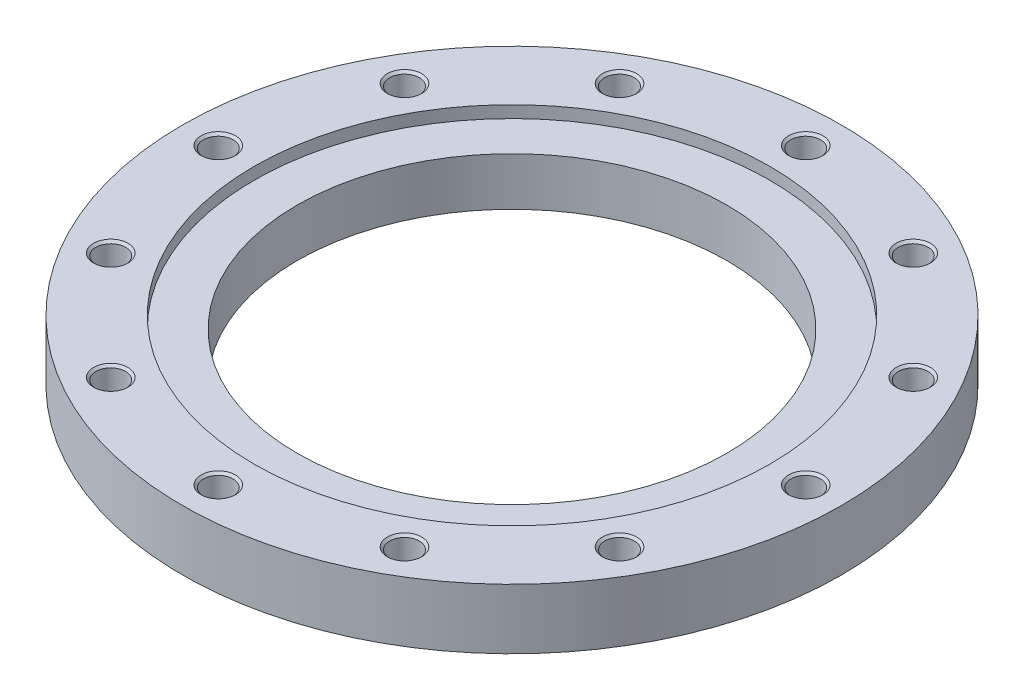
ISO-10303-21;
HEADER;
FILE_DESCRIPTION(('STEP AP214'),'2;1');
FILE_NAME('part.step','',(''),(''),'','','');
FILE_SCHEMA(('AUTOMOTIVE_DESIGN { 1 0 10303 214 1 1 1 1 }'));
ENDSEC;
DATA;
#1=APPLICATION_CONTEXT('core data for automotive mechanical design processes');
#2=APPLICATION_PROTOCOL_DEFINITION('international standard','automotive_design',2000,#1);
#3=PRODUCT_CONTEXT('',#1,'mechanical');
#4=PRODUCT('Part','Part','',(#3));
#5=PRODUCT_RELATED_PRODUCT_CATEGORY('part','',(#4));
#6=PRODUCT_DEFINITION_FORMATION('','',#4);
#7=PRODUCT_DEFINITION_CONTEXT('part definition',#1,'design');
#8=PRODUCT_DEFINITION('design','',#6,#7);
#9=PRODUCT_DEFINITION_SHAPE('','',#8);
#10=(LENGTH_UNIT() NAMED_UNIT(*) SI_UNIT(.MILLI.,.METRE.));
#11=(NAMED_UNIT(*) PLANE_ANGLE_UNIT() SI_UNIT($,.RADIAN.));
#12=(NAMED_UNIT(*) SI_UNIT($,.STERADIAN.) SOLID_ANGLE_UNIT());
#13=UNCERTAINTY_MEASURE_WITH_UNIT(LENGTH_MEASURE(1.E-05),#10,'distance_accuracy_value','');
#14=(GEOMETRIC_REPRESENTATION_CONTEXT(3) GLOBAL_UNCERTAINTY_ASSIGNED_CONTEXT((#13)) GLOBAL_UNIT_ASSIGNED_CONTEXT((#10,
#11,#12)) REPRESENTATION_CONTEXT('',''));
#15=CARTESIAN_POINT('',(0.,0.,0.));
#16=DIRECTION('',(0.,0.,1.));
#17=DIRECTION('',(1.,0.,0.));
#18=AXIS2_PLACEMENT_3D('',#15,#16,#17);
#19=CARTESIAN_POINT('',(0.,21.,0.));
#20=DIRECTION('',(0.,-1.,0.));
#21=DIRECTION('',(1.,0.,0.));
#22=AXIS2_PLACEMENT_3D('',#19,#20,#21);
#23=CYLINDRICAL_SURFACE('',#22,230.);
#24=CARTESIAN_POINT('',(0.,0.,0.));
#25=DIRECTION('',(0.,1.,0.));
#26=DIRECTION('',(1.,0.,0.));
#27=AXIS2_PLACEMENT_3D('',#24,#25,#26);
#28=CIRCLE('',#27,230.);
#29=CARTESIAN_POINT('',(230.,0.,0.));
#30=VERTEX_POINT('',#29);
#31=EDGE_CURVE('E9',#30,#30,#28,.T.);
#32=ORIENTED_EDGE('',*,*,#31,.T.);
#33=EDGE_LOOP('',(#32));
#34=FACE_BOUND('',#33,.T.);
#35=CARTESIAN_POINT('',(0.,42.,0.));
#36=DIRECTION('',(0.,1.,0.));
#37=DIRECTION('',(1.,0.,0.));
#38=AXIS2_PLACEMENT_3D('',#35,#36,#37);
#39=CIRCLE('',#38,230.);
#40=CARTESIAN_POINT('',(230.,42.,0.));
#41=VERTEX_POINT('',#40);
#42=EDGE_CURVE('E240',#41,#41,#39,.T.);
#43=ORIENTED_EDGE('',*,*,#42,.F.);
#44=EDGE_LOOP('',(#43));
#45=FACE_BOUND('',#44,.T.);
#46=ADVANCED_FACE('F15',(#34,#45),#23,.T.);
#47=CARTESIAN_POINT('',(190.,0.,0.));
#48=DIRECTION('',(0.,-1.,0.));
#49=DIRECTION('',(-1.,0.,0.));
#50=AXIS2_PLACEMENT_3D('',#47,#48,#49);
#51=PLANE('',#50);
#52=CARTESIAN_POINT('',(0.,0.,0.));
#53=DIRECTION('',(0.,1.,0.));
#54=DIRECTION('',(1.,0.,0.));
#55=AXIS2_PLACEMENT_3D('',#52,#53,#54);
#56=CIRCLE('',#55,150.);
#57=CARTESIAN_POINT('',(150.,0.,0.));
#58=VERTEX_POINT('',#57);
#59=EDGE_CURVE('E22',#58,#58,#56,.T.);
#60=ORIENTED_EDGE('',*,*,#59,.T.);
#61=EDGE_LOOP('',(#60));
#62=FACE_BOUND('',#61,.T.);
#63=ORIENTED_EDGE('',*,*,#31,.F.);
#64=EDGE_LOOP('',(#63));
#65=FACE_BOUND('',#64,.T.);
#66=ADVANCED_FACE('F404',(#62,#65),#51,.T.);
#67=CARTESIAN_POINT('',(0.,21.,0.));
#68=DIRECTION('',(0.,-1.,0.));
#69=DIRECTION('',(1.,0.,0.));
#70=AXIS2_PLACEMENT_3D('',#67,#68,#69);
#71=CYLINDRICAL_SURFACE('',#70,150.);
#72=ORIENTED_EDGE('',*,*,#59,.F.);
#73=EDGE_LOOP('',(#72));
#74=FACE_BOUND('',#73,.T.);
#75=CARTESIAN_POINT('',(0.,33.6,0.));
#76=DIRECTION('',(0.,1.,0.));
#77=DIRECTION('',(1.,0.,0.));
#78=AXIS2_PLACEMENT_3D('',#75,#76,#77);
#79=CIRCLE('',#78,150.);
#80=CARTESIAN_POINT('',(-150.,33.6,0.));
#81=VERTEX_POINT('',#80);
#82=EDGE_CURVE('E242',#81,#81,#79,.T.);
#83=ORIENTED_EDGE('',*,*,#82,.T.);
#84=EDGE_LOOP('',(#83));
#85=FACE_BOUND('',#84,.T.);
#86=ADVANCED_FACE('F408',(#74,#85),#71,.F.);
#87=CARTESIAN_POINT('',(190.,42.,0.));
#88=DIRECTION('',(0.,1.,0.));
#89=DIRECTION('',(1.,0.,0.));
#90=AXIS2_PLACEMENT_3D('',#87,#88,#89);
#91=PLANE('',#90);
#92=ORIENTED_EDGE('',*,*,#42,.T.);
#93=EDGE_LOOP('',(#92));
#94=FACE_BOUND('',#93,.T.);
#95=CARTESIAN_POINT('',(0.,42.,0.));
#96=DIRECTION('',(0.,-1.,0.));
#97=DIRECTION('',(1.,0.,0.));
#98=AXIS2_PLACEMENT_3D('',#95,#96,#97);
#99=CIRCLE('',#98,180.);
#100=CARTESIAN_POINT('',(-180.,42.,0.));
#101=VERTEX_POINT('',#100);
#102=EDGE_CURVE('E99',#101,#101,#99,.T.);
#103=ORIENTED_EDGE('',*,*,#102,.T.);
#104=EDGE_LOOP('',(#103));
#105=FACE_BOUND('',#104,.T.);
#106=CARTESIAN_POINT('',(205.,42.,0.));
#107=DIRECTION('',(0.,-1.,0.));
#108=DIRECTION('',(1.,0.,0.));
#109=AXIS2_PLACEMENT_3D('',#106,#107,#108);
#110=CIRCLE('',#109,12.);
#111=CARTESIAN_POINT('',(217.,42.,0.));
#112=VERTEX_POINT('',#111);
#113=EDGE_CURVE('E258',#112,#112,#110,.T.);
#114=ORIENTED_EDGE('',*,*,#113,.T.);
#115=EDGE_LOOP('',(#114));
#116=FACE_BOUND('',#115,.T.);
#117=CARTESIAN_POINT('',(177.53520777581,42.,-102.5));
#118=DIRECTION('',(0.,-1.,0.));
#119=DIRECTION('',(0.866025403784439,0.,-0.5));
#120=AXIS2_PLACEMENT_3D('',#117,#118,#119);
#121=CIRCLE('',#120,12.);
#122=CARTESIAN_POINT('',(187.927512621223,42.,-108.5));
#123=VERTEX_POINT('',#122);
#124=EDGE_CURVE('E247',#123,#123,#121,.T.);
#125=ORIENTED_EDGE('',*,*,#124,.T.);
#126=EDGE_LOOP('',(#125));
#127=FACE_BOUND('',#126,.T.);
#128=CARTESIAN_POINT('',(102.5,42.,-177.53520777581));
#129=DIRECTION('',(0.,-1.,0.));
#130=DIRECTION('',(0.5,0.,-0.866025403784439));
#131=AXIS2_PLACEMENT_3D('',#128,#129,#130);
#132=CIRCLE('',#131,12.);
#133=CARTESIAN_POINT('',(108.5,42.,-187.927512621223));
#134=VERTEX_POINT('',#133);
#135=EDGE_CURVE('E232',#134,#134,#132,.T.);
#136=ORIENTED_EDGE('',*,*,#135,.T.);
#137=EDGE_LOOP('',(#136));
#138=FACE_BOUND('',#137,.T.);
#139=CARTESIAN_POINT('',(0.,42.,-205.));
#140=DIRECTION('',(0.,-1.,0.));
#141=DIRECTION('',(0.,0.,-1.));
#142=AXIS2_PLACEMENT_3D('',#139,#140,#141);
#143=CIRCLE('',#142,12.);
#144=CARTESIAN_POINT('',(0.,42.,-217.));
#145=VERTEX_POINT('',#144);
#146=EDGE_CURVE('E214',#145,#145,#143,.T.);
#147=ORIENTED_EDGE('',*,*,#146,.T.);
#148=EDGE_LOOP('',(#147));
#149=FACE_BOUND('',#148,.T.);
#150=CARTESIAN_POINT('',(-102.5,42.,-177.53520777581));
#151=DIRECTION('',(0.,-1.,0.));
#152=DIRECTION('',(-0.5,0.,-0.866025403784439));
#153=AXIS2_PLACEMENT_3D('',#150,#151,#152);
#154=CIRCLE('',#153,12.);
#155=CARTESIAN_POINT('',(-108.5,42.,-187.927512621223));
#156=VERTEX_POINT('',#155);
#157=EDGE_CURVE('E300',#156,#156,#154,.T.);
#158=ORIENTED_EDGE('',*,*,#157,.T.);
#159=EDGE_LOOP('',(#158));
#160=FACE_BOUND('',#159,.T.);
#161=CARTESIAN_POINT('',(-177.53520777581,42.,-102.5));
#162=DIRECTION('',(0.,-1.,0.));
#163=DIRECTION('',(-0.866025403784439,0.,-0.5));
#164=AXIS2_PLACEMENT_3D('',#161,#162,#163);
#165=CIRCLE('',#164,12.);
#166=CARTESIAN_POINT('',(-187.927512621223,42.,-108.5));
#167=VERTEX_POINT('',#166);
#168=EDGE_CURVE('E369',#167,#167,#165,.T.);
#169=ORIENTED_EDGE('',*,*,#168,.T.);
#170=EDGE_LOOP('',(#169));
#171=FACE_BOUND('',#170,.T.);
#172=CARTESIAN_POINT('',(-205.,42.,0.));
#173=DIRECTION('',(0.,-1.,0.));
#174=DIRECTION('',(-1.,0.,0.));
#175=AXIS2_PLACEMENT_3D('',#172,#173,#174);
#176=CIRCLE('',#175,12.);
#177=CARTESIAN_POINT('',(-217.,42.,0.));
#178=VERTEX_POINT('',#177);
#179=EDGE_CURVE('E353',#178,#178,#176,.T.);
#180=ORIENTED_EDGE('',*,*,#179,.T.);
#181=EDGE_LOOP('',(#180));
#182=FACE_BOUND('',#181,.T.);
#183=CARTESIAN_POINT('',(-177.53520777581,42.,102.5));
#184=DIRECTION('',(0.,-1.,0.));
#185=DIRECTION('',(-0.866025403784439,0.,0.5));
#186=AXIS2_PLACEMENT_3D('',#183,#184,#185);
#187=CIRCLE('',#186,12.);
#188=CARTESIAN_POINT('',(-187.927512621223,42.,108.5));
#189=VERTEX_POINT('',#188);
#190=EDGE_CURVE('E339',#189,#189,#187,.T.);
#191=ORIENTED_EDGE('',*,*,#190,.T.);
#192=EDGE_LOOP('',(#191));
#193=FACE_BOUND('',#192,.T.);
#194=CARTESIAN_POINT('',(-102.5,42.,177.53520777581));
#195=DIRECTION('',(0.,-1.,0.));
#196=DIRECTION('',(-0.5,0.,0.866025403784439));
#197=AXIS2_PLACEMENT_3D('',#194,#195,#196);
#198=CIRCLE('',#197,12.);
#199=CARTESIAN_POINT('',(-108.5,42.,187.927512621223));
#200=VERTEX_POINT('',#199);
#201=EDGE_CURVE('E325',#200,#200,#198,.T.);
#202=ORIENTED_EDGE('',*,*,#201,.T.);
#203=EDGE_LOOP('',(#202));
#204=FACE_BOUND('',#203,.T.);
#205=CARTESIAN_POINT('',(0.,42.,205.));
#206=DIRECTION('',(0.,-1.,0.));
#207=DIRECTION('',(0.,0.,1.));
#208=AXIS2_PLACEMENT_3D('',#205,#206,#207);
#209=CIRCLE('',#208,12.);
#210=CARTESIAN_POINT('',(0.,42.,217.));
#211=VERTEX_POINT('',#210);
#212=EDGE_CURVE('E282',#211,#211,#209,.T.);
#213=ORIENTED_EDGE('',*,*,#212,.T.);
#214=EDGE_LOOP('',(#213));
#215=FACE_BOUND('',#214,.T.);
#216=CARTESIAN_POINT('',(102.5,42.,177.53520777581));
#217=DIRECTION('',(0.,-1.,0.));
#218=DIRECTION('',(0.5,0.,0.866025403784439));
#219=AXIS2_PLACEMENT_3D('',#216,#217,#218);
#220=CIRCLE('',#219,12.);
#221=CARTESIAN_POINT('',(108.5,42.,187.927512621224));
#222=VERTEX_POINT('',#221);
#223=EDGE_CURVE('E275',#222,#222,#220,.T.);
#224=ORIENTED_EDGE('',*,*,#223,.T.);
#225=EDGE_LOOP('',(#224));
#226=FACE_BOUND('',#225,.T.);
#227=CARTESIAN_POINT('',(177.53520777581,42.,102.5));
#228=DIRECTION('',(0.,-1.,0.));
#229=DIRECTION('',(0.866025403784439,0.,0.5));
#230=AXIS2_PLACEMENT_3D('',#227,#228,#229);
#231=CIRCLE('',#230,12.);
#232=CARTESIAN_POINT('',(187.927512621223,42.,108.5));
#233=VERTEX_POINT('',#232);
#234=EDGE_CURVE('E446',#233,#233,#231,.T.);
#235=ORIENTED_EDGE('',*,*,#234,.T.);
#236=EDGE_LOOP('',(#235));
#237=FACE_BOUND('',#236,.T.);
#238=ADVANCED_FACE('F215',(#94,#105,#116,#127,#138,#149,#160,#171,#182,#193,#204,#215,#226,
#237),#91,.T.);
#239=CARTESIAN_POINT('',(0.,33.6,0.));
#240=DIRECTION('',(0.,-1.,0.));
#241=DIRECTION('',(-1.,0.,0.));
#242=AXIS2_PLACEMENT_3D('',#239,#240,#241);
#243=PLANE('',#242);
#244=CARTESIAN_POINT('',(0.,33.6,0.));
#245=DIRECTION('',(0.,-1.,0.));
#246=DIRECTION('',(1.,0.,0.));
#247=AXIS2_PLACEMENT_3D('',#244,#245,#246);
#248=CIRCLE('',#247,180.);
#249=CARTESIAN_POINT('',(180.,33.6,0.));
#250=VERTEX_POINT('',#249);
#251=EDGE_CURVE('E104',#250,#250,#248,.T.);
#252=ORIENTED_EDGE('',*,*,#251,.F.);
#253=EDGE_LOOP('',(#252));
#254=FACE_BOUND('',#253,.T.);
#255=ORIENTED_EDGE('',*,*,#82,.F.);
#256=EDGE_LOOP('',(#255));
#257=FACE_BOUND('',#256,.T.);
#258=ADVANCED_FACE('F413',(#254,#257),#243,.F.);
#259=CARTESIAN_POINT('',(0.,39.9,0.));
#260=DIRECTION('',(0.,-1.,0.));
#261=DIRECTION('',(1.,0.,0.));
#262=AXIS2_PLACEMENT_3D('',#259,#260,#261);
#263=CYLINDRICAL_SURFACE('',#262,180.);
#264=ORIENTED_EDGE('',*,*,#251,.T.);
#265=EDGE_LOOP('',(#264));
#266=FACE_BOUND('',#265,.T.);
#267=ORIENTED_EDGE('',*,*,#102,.F.);
#268=EDGE_LOOP('',(#267));
#269=FACE_BOUND('',#268,.T.);
#270=ADVANCED_FACE('F657',(#266,#269),#263,.F.);
#271=CARTESIAN_POINT('',(205.,6.00463463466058,0.));
#272=DIRECTION('',(0.,1.,0.));
#273=DIRECTION('',(1.,0.,0.));
#274=AXIS2_PLACEMENT_3D('',#271,#272,#273);
#275=CONICAL_SURFACE('',#274,5.188125,1.0471975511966);
#276=CARTESIAN_POINT('',(205.,9.,0.));
#277=DIRECTION('',(0.,-1.,0.));
#278=DIRECTION('',(1.,0.,0.));
#279=AXIS2_PLACEMENT_3D('',#276,#277,#278);
#280=CIRCLE('',#279,10.37625);
#281=CARTESIAN_POINT('',(215.37625,9.,0.));
#282=VERTEX_POINT('',#281);
#283=EDGE_CURVE('E267',#282,#282,#280,.T.);
#284=ORIENTED_EDGE('',*,*,#283,.F.);
#285=EDGE_LOOP('',(#284));
#286=FACE_BOUND('',#285,.T.);
#287=CARTESIAN_POINT('',(205.,3.00926926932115,0.));
#288=VERTEX_POINT('',#287);
#289=VERTEX_LOOP('',#288);
#290=FACE_BOUND('',#289,.T.);
#291=ADVANCED_FACE('F941',(#286,#290),#275,.F.);
#292=CARTESIAN_POINT('',(205.,12.688125,0.));
#293=DIRECTION('',(0.,1.,0.));
#294=DIRECTION('',(1.,0.,0.));
#295=AXIS2_PLACEMENT_3D('',#292,#293,#294);
#296=CYLINDRICAL_SURFACE('',#295,10.37625);
#297=CARTESIAN_POINT('',(205.,16.37625,0.));
#298=DIRECTION('',(0.,-1.,0.));
#299=DIRECTION('',(1.,0.,0.));
#300=AXIS2_PLACEMENT_3D('',#297,#298,#299);
#301=CIRCLE('',#300,10.37625);
#302=CARTESIAN_POINT('',(215.37625,16.37625,0.));
#303=VERTEX_POINT('',#302);
#304=EDGE_CURVE('E264',#303,#303,#301,.T.);
#305=ORIENTED_EDGE('',*,*,#304,.F.);
#306=EDGE_LOOP('',(#305));
#307=FACE_BOUND('',#306,.T.);
#308=ORIENTED_EDGE('',*,*,#283,.T.);
#309=EDGE_LOOP('',(#308));
#310=FACE_BOUND('',#309,.T.);
#311=ADVANCED_FACE('F929',(#307,#310),#296,.F.);
#312=CARTESIAN_POINT('',(205.,17.188125,0.));
#313=DIRECTION('',(0.,1.,0.));
#314=DIRECTION('',(1.,0.,0.));
#315=AXIS2_PLACEMENT_3D('',#312,#313,#314);
#316=CONICAL_SURFACE('',#315,11.188125,0.785398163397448);
#317=CARTESIAN_POINT('',(205.,18.,0.));
#318=DIRECTION('',(0.,-1.,0.));
#319=DIRECTION('',(1.,0.,0.));
#320=AXIS2_PLACEMENT_3D('',#317,#318,#319);
#321=CIRCLE('',#320,12.);
#322=CARTESIAN_POINT('',(217.,18.,0.));
#323=VERTEX_POINT('',#322);
#324=EDGE_CURVE('E262',#323,#323,#321,.T.);
#325=ORIENTED_EDGE('',*,*,#324,.F.);
#326=EDGE_LOOP('',(#325));
#327=FACE_BOUND('',#326,.T.);
#328=ORIENTED_EDGE('',*,*,#304,.T.);
#329=EDGE_LOOP('',(#328));
#330=FACE_BOUND('',#329,.T.);
#331=ADVANCED_FACE('F924',(#327,#330),#316,.F.);
#332=CARTESIAN_POINT('',(216.188125,18.,0.));
#333=DIRECTION('',(0.,1.,0.));
#334=DIRECTION('',(-1.,0.,0.));
#335=AXIS2_PLACEMENT_3D('',#332,#333,#334);
#336=PLANE('',#335);
#337=CARTESIAN_POINT('',(205.,18.,0.));
#338=DIRECTION('',(0.,-1.,0.));
#339=DIRECTION('',(1.,0.,0.));
#340=AXIS2_PLACEMENT_3D('',#337,#338,#339);
#341=CIRCLE('',#340,10.37625);
#342=CARTESIAN_POINT('',(215.37625,18.,0.));
#343=VERTEX_POINT('',#342);
#344=EDGE_CURVE('E260',#343,#343,#341,.T.);
#345=ORIENTED_EDGE('',*,*,#344,.F.);
#346=EDGE_LOOP('',(#345));
#347=FACE_BOUND('',#346,.T.);
#348=ORIENTED_EDGE('',*,*,#324,.T.);
#349=EDGE_LOOP('',(#348));
#350=FACE_BOUND('',#349,.T.);
#351=ADVANCED_FACE('F512',(#347,#350),#336,.F.);
#352=CARTESIAN_POINT('',(205.,29.188125,0.));
#353=DIRECTION('',(0.,1.,0.));
#354=DIRECTION('',(1.,0.,0.));
#355=AXIS2_PLACEMENT_3D('',#352,#353,#354);
#356=CYLINDRICAL_SURFACE('',#355,10.37625);
#357=CARTESIAN_POINT('',(205.,40.37625,0.));
#358=DIRECTION('',(0.,-1.,0.));
#359=DIRECTION('',(1.,0.,0.));
#360=AXIS2_PLACEMENT_3D('',#357,#358,#359);
#361=CIRCLE('',#360,10.37625);
#362=CARTESIAN_POINT('',(215.37625,40.37625,0.));
#363=VERTEX_POINT('',#362);
#364=EDGE_CURVE('E256',#363,#363,#361,.T.);
#365=ORIENTED_EDGE('',*,*,#364,.F.);
#366=EDGE_LOOP('',(#365));
#367=FACE_BOUND('',#366,.T.);
#368=ORIENTED_EDGE('',*,*,#344,.T.);
#369=EDGE_LOOP('',(#368));
#370=FACE_BOUND('',#369,.T.);
#371=ADVANCED_FACE('F508',(#367,#370),#356,.F.);
#372=CARTESIAN_POINT('',(205.,41.188125,0.));
#373=DIRECTION('',(0.,1.,0.));
#374=DIRECTION('',(1.,0.,0.));
#375=AXIS2_PLACEMENT_3D('',#372,#373,#374);
#376=CONICAL_SURFACE('',#375,11.188125,0.785398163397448);
#377=ORIENTED_EDGE('',*,*,#113,.F.);
#378=EDGE_LOOP('',(#377));
#379=FACE_BOUND('',#378,.T.);
#380=ORIENTED_EDGE('',*,*,#364,.T.);
#381=EDGE_LOOP('',(#380));
#382=FACE_BOUND('',#381,.T.);
#383=ADVANCED_FACE('F511',(#379,#382),#376,.F.);
#384=CARTESIAN_POINT('',(177.53520777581,6.00463463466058,-102.5));
#385=DIRECTION('',(0.,1.,0.));
#386=DIRECTION('',(0.866025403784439,0.,-0.5));
#387=AXIS2_PLACEMENT_3D('',#384,#385,#386);
#388=CONICAL_SURFACE('',#387,5.188125,1.0471975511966);
#389=CARTESIAN_POINT('',(177.53520777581,9.,-102.5));
#390=DIRECTION('',(0.,-1.,0.));
#391=DIRECTION('',(0.866025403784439,0.,-0.5));
#392=AXIS2_PLACEMENT_3D('',#389,#390,#391);
#393=CIRCLE('',#392,10.37625);
#394=CARTESIAN_POINT('',(186.521303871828,9.,-107.688125));
#395=VERTEX_POINT('',#394);
#396=EDGE_CURVE('E254',#395,#395,#393,.T.);
#397=ORIENTED_EDGE('',*,*,#396,.F.);
#398=EDGE_LOOP('',(#397));
#399=FACE_BOUND('',#398,.T.);
#400=CARTESIAN_POINT('',(177.53520777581,3.00926926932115,-102.5));
#401=VERTEX_POINT('',#400);
#402=VERTEX_LOOP('',#401);
#403=FACE_BOUND('',#402,.T.);
#404=ADVANCED_FACE('F1006',(#399,#403),#388,.F.);
#405=CARTESIAN_POINT('',(177.53520777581,12.688125,-102.5));
#406=DIRECTION('',(0.,1.,0.));
#407=DIRECTION('',(0.866025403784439,0.,-0.5));
#408=AXIS2_PLACEMENT_3D('',#405,#406,#407);
#409=CYLINDRICAL_SURFACE('',#408,10.37625);
#410=CARTESIAN_POINT('',(177.53520777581,16.37625,-102.5));
#411=DIRECTION('',(0.,-1.,0.));
#412=DIRECTION('',(0.866025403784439,0.,-0.5));
#413=AXIS2_PLACEMENT_3D('',#410,#411,#412);
#414=CIRCLE('',#413,10.37625);
#415=CARTESIAN_POINT('',(186.521303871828,16.37625,-107.688125));
#416=VERTEX_POINT('',#415);
#417=EDGE_CURVE('E251',#416,#416,#414,.T.);
#418=ORIENTED_EDGE('',*,*,#417,.F.);
#419=EDGE_LOOP('',(#418));
#420=FACE_BOUND('',#419,.T.);
#421=ORIENTED_EDGE('',*,*,#396,.T.);
#422=EDGE_LOOP('',(#421));
#423=FACE_BOUND('',#422,.T.);
#424=ADVANCED_FACE('F917',(#420,#423),#409,.F.);
#425=CARTESIAN_POINT('',(177.53520777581,17.188125,-102.5));
#426=DIRECTION('',(0.,1.,0.));
#427=DIRECTION('',(0.866025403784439,0.,-0.5));
#428=AXIS2_PLACEMENT_3D('',#425,#426,#427);
#429=CONICAL_SURFACE('',#428,11.188125,0.785398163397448);
#430=CARTESIAN_POINT('',(177.53520777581,18.,-102.5));
#431=DIRECTION('',(0.,-1.,0.));
#432=DIRECTION('',(0.866025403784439,0.,-0.5));
#433=AXIS2_PLACEMENT_3D('',#430,#431,#432);
#434=CIRCLE('',#433,12.);
#435=CARTESIAN_POINT('',(187.927512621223,18.,-108.5));
#436=VERTEX_POINT('',#435);
#437=EDGE_CURVE('E248',#436,#436,#434,.T.);
#438=ORIENTED_EDGE('',*,*,#437,.F.);
#439=EDGE_LOOP('',(#438));
#440=FACE_BOUND('',#439,.T.);
#441=ORIENTED_EDGE('',*,*,#417,.T.);
#442=EDGE_LOOP('',(#441));
#443=FACE_BOUND('',#442,.T.);
#444=ADVANCED_FACE('F914',(#440,#443),#429,.F.);
#445=CARTESIAN_POINT('',(187.224408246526,18.,-108.0940625));
#446=DIRECTION('',(0.,1.,0.));
#447=DIRECTION('',(-0.866025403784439,0.,0.5));
#448=AXIS2_PLACEMENT_3D('',#445,#446,#447);
#449=PLANE('',#448);
#450=CARTESIAN_POINT('',(177.53520777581,18.,-102.5));
#451=DIRECTION('',(0.,-1.,0.));
#452=DIRECTION('',(0.866025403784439,0.,-0.5));
#453=AXIS2_PLACEMENT_3D('',#450,#451,#452);
#454=CIRCLE('',#453,10.37625);
#455=CARTESIAN_POINT('',(186.521303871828,18.,-107.688125));
#456=VERTEX_POINT('',#455);
#457=EDGE_CURVE('E252',#456,#456,#454,.T.);
#458=ORIENTED_EDGE('',*,*,#457,.F.);
#459=EDGE_LOOP('',(#458));
#460=FACE_BOUND('',#459,.T.);
#461=ORIENTED_EDGE('',*,*,#437,.T.);
#462=EDGE_LOOP('',(#461));
#463=FACE_BOUND('',#462,.T.);
#464=ADVANCED_FACE('F916',(#460,#463),#449,.F.);
#465=CARTESIAN_POINT('',(177.53520777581,29.188125,-102.5));
#466=DIRECTION('',(0.,1.,0.));
#467=DIRECTION('',(0.866025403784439,0.,-0.5));
#468=AXIS2_PLACEMENT_3D('',#465,#466,#467);
#469=CYLINDRICAL_SURFACE('',#468,10.37625);
#470=CARTESIAN_POINT('',(177.53520777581,40.37625,-102.5));
#471=DIRECTION('',(0.,-1.,0.));
#472=DIRECTION('',(0.866025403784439,0.,-0.5));
#473=AXIS2_PLACEMENT_3D('',#470,#471,#472);
#474=CIRCLE('',#473,10.37625);
#475=CARTESIAN_POINT('',(186.521303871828,40.37625,-107.688125));
#476=VERTEX_POINT('',#475);
#477=EDGE_CURVE('E245',#476,#476,#474,.T.);
#478=ORIENTED_EDGE('',*,*,#477,.F.);
#479=EDGE_LOOP('',(#478));
#480=FACE_BOUND('',#479,.T.);
#481=ORIENTED_EDGE('',*,*,#457,.T.);
#482=EDGE_LOOP('',(#481));
#483=FACE_BOUND('',#482,.T.);
#484=ADVANCED_FACE('F1040',(#480,#483),#469,.F.);
#485=CARTESIAN_POINT('',(177.53520777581,41.188125,-102.5));
#486=DIRECTION('',(0.,1.,0.));
#487=DIRECTION('',(0.866025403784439,0.,-0.5));
#488=AXIS2_PLACEMENT_3D('',#485,#486,#487);
#489=CONICAL_SURFACE('',#488,11.188125,0.785398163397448);
#490=ORIENTED_EDGE('',*,*,#124,.F.);
#491=EDGE_LOOP('',(#490));
#492=FACE_BOUND('',#491,.T.);
#493=ORIENTED_EDGE('',*,*,#477,.T.);
#494=EDGE_LOOP('',(#493));
#495=FACE_BOUND('',#494,.T.);
#496=ADVANCED_FACE('F1050',(#492,#495),#489,.F.);
#497=CARTESIAN_POINT('',(102.5,6.00463463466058,-177.53520777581));
#498=DIRECTION('',(0.,1.,0.));
#499=DIRECTION('',(0.5,0.,-0.866025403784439));
#500=AXIS2_PLACEMENT_3D('',#497,#498,#499);
#501=CONICAL_SURFACE('',#500,5.188125,1.0471975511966);
#502=CARTESIAN_POINT('',(102.5,9.,-177.53520777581));
#503=DIRECTION('',(0.,-1.,0.));
#504=DIRECTION('',(0.5,0.,-0.866025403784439));
#505=AXIS2_PLACEMENT_3D('',#502,#503,#504);
#506=CIRCLE('',#505,10.37625);
#507=CARTESIAN_POINT('',(107.688125,9.,-186.521303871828));
#508=VERTEX_POINT('',#507);
#509=EDGE_CURVE('E239',#508,#508,#506,.T.);
#510=ORIENTED_EDGE('',*,*,#509,.F.);
#511=EDGE_LOOP('',(#510));
#512=FACE_BOUND('',#511,.T.);
#513=CARTESIAN_POINT('',(102.5,3.00926926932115,-177.53520777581));
#514=VERTEX_POINT('',#513);
#515=VERTEX_LOOP('',#514);
#516=FACE_BOUND('',#515,.T.);
#517=ADVANCED_FACE('F1060',(#512,#516),#501,.F.);
#518=CARTESIAN_POINT('',(102.5,12.688125,-177.53520777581));
#519=DIRECTION('',(0.,1.,0.));
#520=DIRECTION('',(0.5,0.,-0.866025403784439));
#521=AXIS2_PLACEMENT_3D('',#518,#519,#520);
#522=CYLINDRICAL_SURFACE('',#521,10.37625);
#523=CARTESIAN_POINT('',(102.5,16.37625,-177.53520777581));
#524=DIRECTION('',(0.,-1.,0.));
#525=DIRECTION('',(0.5,0.,-0.866025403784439));
#526=AXIS2_PLACEMENT_3D('',#523,#524,#525);
#527=CIRCLE('',#526,10.37625);
#528=CARTESIAN_POINT('',(107.688125,16.37625,-186.521303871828));
#529=VERTEX_POINT('',#528);
#530=EDGE_CURVE('E237',#529,#529,#527,.T.);
#531=ORIENTED_EDGE('',*,*,#530,.F.);
#532=EDGE_LOOP('',(#531));
#533=FACE_BOUND('',#532,.T.);
#534=ORIENTED_EDGE('',*,*,#509,.T.);
#535=EDGE_LOOP('',(#534));
#536=FACE_BOUND('',#535,.T.);
#537=ADVANCED_FACE('F912',(#533,#536),#522,.F.);
#538=CARTESIAN_POINT('',(102.5,17.188125,-177.53520777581));
#539=DIRECTION('',(0.,1.,0.));
#540=DIRECTION('',(0.5,0.,-0.866025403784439));
#541=AXIS2_PLACEMENT_3D('',#538,#539,#540);
#542=CONICAL_SURFACE('',#541,11.188125,0.785398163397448);
#543=CARTESIAN_POINT('',(102.5,18.,-177.53520777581));
#544=DIRECTION('',(0.,-1.,0.));
#545=DIRECTION('',(0.5,0.,-0.866025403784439));
#546=AXIS2_PLACEMENT_3D('',#543,#544,#545);
#547=CIRCLE('',#546,12.);
#548=CARTESIAN_POINT('',(108.5,18.,-187.927512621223));
#549=VERTEX_POINT('',#548);
#550=EDGE_CURVE('E236',#549,#549,#547,.T.);
#551=ORIENTED_EDGE('',*,*,#550,.F.);
#552=EDGE_LOOP('',(#551));
#553=FACE_BOUND('',#552,.T.);
#554=ORIENTED_EDGE('',*,*,#530,.T.);
#555=EDGE_LOOP('',(#554));
#556=FACE_BOUND('',#555,.T.);
#557=ADVANCED_FACE('F439',(#553,#556),#542,.F.);
#558=CARTESIAN_POINT('',(108.0940625,18.,-187.224408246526));
#559=DIRECTION('',(0.,1.,0.));
#560=DIRECTION('',(-0.5,0.,0.866025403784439));
#561=AXIS2_PLACEMENT_3D('',#558,#559,#560);
#562=PLANE('',#561);
#563=CARTESIAN_POINT('',(102.5,18.,-177.53520777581));
#564=DIRECTION('',(0.,-1.,0.));
#565=DIRECTION('',(0.5,0.,-0.866025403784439));
#566=AXIS2_PLACEMENT_3D('',#563,#564,#565);
#567=CIRCLE('',#566,10.37625);
#568=CARTESIAN_POINT('',(107.688125,18.,-186.521303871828));
#569=VERTEX_POINT('',#568);
#570=EDGE_CURVE('E233',#569,#569,#567,.T.);
#571=ORIENTED_EDGE('',*,*,#570,.F.);
#572=EDGE_LOOP('',(#571));
#573=FACE_BOUND('',#572,.T.);
#574=ORIENTED_EDGE('',*,*,#550,.T.);
#575=EDGE_LOOP('',(#574));
#576=FACE_BOUND('',#575,.T.);
#577=ADVANCED_FACE('F432',(#573,#576),#562,.F.);
#578=CARTESIAN_POINT('',(102.5,29.188125,-177.53520777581));
#579=DIRECTION('',(0.,1.,0.));
#580=DIRECTION('',(0.5,0.,-0.866025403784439));
#581=AXIS2_PLACEMENT_3D('',#578,#579,#580);
#582=CYLINDRICAL_SURFACE('',#581,10.37625);
#583=CARTESIAN_POINT('',(102.5,40.37625,-177.53520777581));
#584=DIRECTION('',(0.,-1.,0.));
#585=DIRECTION('',(0.5,0.,-0.866025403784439));
#586=AXIS2_PLACEMENT_3D('',#583,#584,#585);
#587=CIRCLE('',#586,10.37625);
#588=CARTESIAN_POINT('',(107.688125,40.37625,-186.521303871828));
#589=VERTEX_POINT('',#588);
#590=EDGE_CURVE('E230',#589,#589,#587,.T.);
#591=ORIENTED_EDGE('',*,*,#590,.F.);
#592=EDGE_LOOP('',(#591));
#593=FACE_BOUND('',#592,.T.);
#594=ORIENTED_EDGE('',*,*,#570,.T.);
#595=EDGE_LOOP('',(#594));
#596=FACE_BOUND('',#595,.T.);
#597=ADVANCED_FACE('F426',(#593,#596),#582,.F.);
#598=CARTESIAN_POINT('',(102.5,41.188125,-177.53520777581));
#599=DIRECTION('',(0.,1.,0.));
#600=DIRECTION('',(0.5,0.,-0.866025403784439));
#601=AXIS2_PLACEMENT_3D('',#598,#599,#600);
#602=CONICAL_SURFACE('',#601,11.188125,0.785398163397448);
#603=ORIENTED_EDGE('',*,*,#135,.F.);
#604=EDGE_LOOP('',(#603));
#605=FACE_BOUND('',#604,.T.);
#606=ORIENTED_EDGE('',*,*,#590,.T.);
#607=EDGE_LOOP('',(#606));
#608=FACE_BOUND('',#607,.T.);
#609=ADVANCED_FACE('F422',(#605,#608),#602,.F.);
#610=CARTESIAN_POINT('',(0.,6.00463463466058,-205.));
#611=DIRECTION('',(0.,1.,0.));
#612=DIRECTION('',(0.,0.,-1.));
#613=AXIS2_PLACEMENT_3D('',#610,#611,#612);
#614=CONICAL_SURFACE('',#613,5.188125,1.0471975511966);
#615=CARTESIAN_POINT('',(0.,9.,-205.));
#616=DIRECTION('',(0.,-1.,0.));
#617=DIRECTION('',(0.,0.,-1.));
#618=AXIS2_PLACEMENT_3D('',#615,#616,#617);
#619=CIRCLE('',#618,10.37625);
#620=CARTESIAN_POINT('',(0.,9.,-215.37625));
#621=VERTEX_POINT('',#620);
#622=EDGE_CURVE('E228',#621,#621,#619,.T.);
#623=ORIENTED_EDGE('',*,*,#622,.F.);
#624=EDGE_LOOP('',(#623));
#625=FACE_BOUND('',#624,.T.);
#626=CARTESIAN_POINT('',(0.,3.00926926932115,-205.));
#627=VERTEX_POINT('',#626);
#628=VERTEX_LOOP('',#627);
#629=FACE_BOUND('',#628,.T.);
#630=ADVANCED_FACE('F425',(#625,#629),#614,.F.);
#631=CARTESIAN_POINT('',(0.,12.688125,-205.));
#632=DIRECTION('',(0.,1.,0.));
#633=DIRECTION('',(0.,0.,-1.));
#634=AXIS2_PLACEMENT_3D('',#631,#632,#633);
#635=CYLINDRICAL_SURFACE('',#634,10.37625);
#636=CARTESIAN_POINT('',(0.,16.37625,-205.));
#637=DIRECTION('',(0.,-1.,0.));
#638=DIRECTION('',(0.,0.,-1.));
#639=AXIS2_PLACEMENT_3D('',#636,#637,#638);
#640=CIRCLE('',#639,10.37625);
#641=CARTESIAN_POINT('',(0.,16.37625,-215.37625));
#642=VERTEX_POINT('',#641);
#643=EDGE_CURVE('E227',#642,#642,#640,.T.);
#644=ORIENTED_EDGE('',*,*,#643,.F.);
#645=EDGE_LOOP('',(#644));
#646=FACE_BOUND('',#645,.T.);
#647=ORIENTED_EDGE('',*,*,#622,.T.);
#648=EDGE_LOOP('',(#647));
#649=FACE_BOUND('',#648,.T.);
#650=ADVANCED_FACE('F1112',(#646,#649),#635,.F.);
#651=CARTESIAN_POINT('',(0.,17.188125,-205.));
#652=DIRECTION('',(0.,1.,0.));
#653=DIRECTION('',(0.,0.,-1.));
#654=AXIS2_PLACEMENT_3D('',#651,#652,#653);
#655=CONICAL_SURFACE('',#654,11.188125,0.785398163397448);
#656=CARTESIAN_POINT('',(0.,18.,-205.));
#657=DIRECTION('',(0.,-1.,0.));
#658=DIRECTION('',(0.,0.,-1.));
#659=AXIS2_PLACEMENT_3D('',#656,#657,#658);
#660=CIRCLE('',#659,12.);
#661=CARTESIAN_POINT('',(0.,18.,-217.));
#662=VERTEX_POINT('',#661);
#663=EDGE_CURVE('E220',#662,#662,#660,.T.);
#664=ORIENTED_EDGE('',*,*,#663,.F.);
#665=EDGE_LOOP('',(#664));
#666=FACE_BOUND('',#665,.T.);
#667=ORIENTED_EDGE('',*,*,#643,.T.);
#668=EDGE_LOOP('',(#667));
#669=FACE_BOUND('',#668,.T.);
#670=ADVANCED_FACE('F1122',(#666,#669),#655,.F.);
#671=CARTESIAN_POINT('',(0.,18.,-216.188125));
#672=DIRECTION('',(0.,1.,0.));
#673=DIRECTION('',(0.,0.,1.));
#674=AXIS2_PLACEMENT_3D('',#671,#672,#673);
#675=PLANE('',#674);
#676=CARTESIAN_POINT('',(0.,18.,-205.));
#677=DIRECTION('',(0.,-1.,0.));
#678=DIRECTION('',(0.,0.,-1.));
#679=AXIS2_PLACEMENT_3D('',#676,#677,#678);
#680=CIRCLE('',#679,10.37625);
#681=CARTESIAN_POINT('',(0.,18.,-215.37625));
#682=VERTEX_POINT('',#681);
#683=EDGE_CURVE('E218',#682,#682,#680,.T.);
#684=ORIENTED_EDGE('',*,*,#683,.F.);
#685=EDGE_LOOP('',(#684));
#686=FACE_BOUND('',#685,.T.);
#687=ORIENTED_EDGE('',*,*,#663,.T.);
#688=EDGE_LOOP('',(#687));
#689=FACE_BOUND('',#688,.T.);
#690=ADVANCED_FACE('F921',(#686,#689),#675,.F.);
#691=CARTESIAN_POINT('',(0.,29.188125,-205.));
#692=DIRECTION('',(0.,1.,0.));
#693=DIRECTION('',(0.,0.,-1.));
#694=AXIS2_PLACEMENT_3D('',#691,#692,#693);
#695=CYLINDRICAL_SURFACE('',#694,10.37625);
#696=CARTESIAN_POINT('',(0.,40.37625,-205.));
#697=DIRECTION('',(0.,-1.,0.));
#698=DIRECTION('',(0.,0.,-1.));
#699=AXIS2_PLACEMENT_3D('',#696,#697,#698);
#700=CIRCLE('',#699,10.37625);
#701=CARTESIAN_POINT('',(0.,40.37625,-215.37625));
#702=VERTEX_POINT('',#701);
#703=EDGE_CURVE('E210',#702,#702,#700,.T.);
#704=ORIENTED_EDGE('',*,*,#703,.F.);
#705=EDGE_LOOP('',(#704));
#706=FACE_BOUND('',#705,.T.);
#707=ORIENTED_EDGE('',*,*,#683,.T.);
#708=EDGE_LOOP('',(#707));
#709=FACE_BOUND('',#708,.T.);
#710=ADVANCED_FACE('F401',(#706,#709),#695,.F.);
#711=CARTESIAN_POINT('',(0.,41.188125,-205.));
#712=DIRECTION('',(0.,1.,0.));
#713=DIRECTION('',(0.,0.,-1.));
#714=AXIS2_PLACEMENT_3D('',#711,#712,#713);
#715=CONICAL_SURFACE('',#714,11.188125,0.785398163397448);
#716=ORIENTED_EDGE('',*,*,#146,.F.);
#717=EDGE_LOOP('',(#716));
#718=FACE_BOUND('',#717,.T.);
#719=ORIENTED_EDGE('',*,*,#703,.T.);
#720=EDGE_LOOP('',(#719));
#721=FACE_BOUND('',#720,.T.);
#722=ADVANCED_FACE('F395',(#718,#721),#715,.F.);
#723=CARTESIAN_POINT('',(-102.5,6.00463463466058,-177.53520777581));
#724=DIRECTION('',(0.,1.,0.));
#725=DIRECTION('',(-0.5,0.,-0.866025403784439));
#726=AXIS2_PLACEMENT_3D('',#723,#724,#725);
#727=CONICAL_SURFACE('',#726,5.188125,1.0471975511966);
#728=CARTESIAN_POINT('',(-102.5,9.,-177.53520777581));
#729=DIRECTION('',(0.,-1.,0.));
#730=DIRECTION('',(-0.5,0.,-0.866025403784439));
#731=AXIS2_PLACEMENT_3D('',#728,#729,#730);
#732=CIRCLE('',#731,10.37625);
#733=CARTESIAN_POINT('',(-107.688125,9.,-186.521303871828));
#734=VERTEX_POINT('',#733);
#735=EDGE_CURVE('E222',#734,#734,#732,.T.);
#736=ORIENTED_EDGE('',*,*,#735,.F.);
#737=EDGE_LOOP('',(#736));
#738=FACE_BOUND('',#737,.T.);
#739=CARTESIAN_POINT('',(-102.5,3.00926926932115,-177.53520777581));
#740=VERTEX_POINT('',#739);
#741=VERTEX_LOOP('',#740);
#742=FACE_BOUND('',#741,.T.);
#743=ADVANCED_FACE('F389',(#738,#742),#727,.F.);
#744=CARTESIAN_POINT('',(-102.5,12.688125,-177.53520777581));
#745=DIRECTION('',(0.,1.,0.));
#746=DIRECTION('',(-0.5,0.,-0.866025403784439));
#747=AXIS2_PLACEMENT_3D('',#744,#745,#746);
#748=CYLINDRICAL_SURFACE('',#747,10.37625);
#749=CARTESIAN_POINT('',(-102.5,16.37625,-177.53520777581));
#750=DIRECTION('',(0.,-1.,0.));
#751=DIRECTION('',(-0.5,0.,-0.866025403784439));
#752=AXIS2_PLACEMENT_3D('',#749,#750,#751);
#753=CIRCLE('',#752,10.37625);
#754=CARTESIAN_POINT('',(-107.688125,16.37625,-186.521303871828));
#755=VERTEX_POINT('',#754);
#756=EDGE_CURVE('E367',#755,#755,#753,.T.);
#757=ORIENTED_EDGE('',*,*,#756,.F.);
#758=EDGE_LOOP('',(#757));
#759=FACE_BOUND('',#758,.T.);
#760=ORIENTED_EDGE('',*,*,#735,.T.);
#761=EDGE_LOOP('',(#760));
#762=FACE_BOUND('',#761,.T.);
#763=ADVANCED_FACE('F386',(#759,#762),#748,.F.);
#764=CARTESIAN_POINT('',(-102.5,17.188125,-177.53520777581));
#765=DIRECTION('',(0.,1.,0.));
#766=DIRECTION('',(-0.5,0.,-0.866025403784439));
#767=AXIS2_PLACEMENT_3D('',#764,#765,#766);
#768=CONICAL_SURFACE('',#767,11.188125,0.785398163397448);
#769=CARTESIAN_POINT('',(-102.5,18.,-177.53520777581));
#770=DIRECTION('',(0.,-1.,0.));
#771=DIRECTION('',(-0.5,0.,-0.866025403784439));
#772=AXIS2_PLACEMENT_3D('',#769,#770,#771);
#773=CIRCLE('',#772,12.);
#774=CARTESIAN_POINT('',(-108.5,18.,-187.927512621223));
#775=VERTEX_POINT('',#774);
#776=EDGE_CURVE('E380',#775,#775,#773,.T.);
#777=ORIENTED_EDGE('',*,*,#776,.F.);
#778=EDGE_LOOP('',(#777));
#779=FACE_BOUND('',#778,.T.);
#780=ORIENTED_EDGE('',*,*,#756,.T.);
#781=EDGE_LOOP('',(#780));
#782=FACE_BOUND('',#781,.T.);
#783=ADVANCED_FACE('F384',(#779,#782),#768,.F.);
#784=CARTESIAN_POINT('',(-108.0940625,18.,-187.224408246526));
#785=DIRECTION('',(0.,1.,0.));
#786=DIRECTION('',(0.5,0.,0.866025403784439));
#787=AXIS2_PLACEMENT_3D('',#784,#785,#786);
#788=PLANE('',#787);
#789=CARTESIAN_POINT('',(-102.5,18.,-177.53520777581));
#790=DIRECTION('',(0.,-1.,0.));
#791=DIRECTION('',(-0.5,0.,-0.866025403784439));
#792=AXIS2_PLACEMENT_3D('',#789,#790,#791);
#793=CIRCLE('',#792,10.37625);
#794=CARTESIAN_POINT('',(-107.688125,18.,-186.521303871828));
#795=VERTEX_POINT('',#794);
#796=EDGE_CURVE('E303',#795,#795,#793,.T.);
#797=ORIENTED_EDGE('',*,*,#796,.F.);
#798=EDGE_LOOP('',(#797));
#799=FACE_BOUND('',#798,.T.);
#800=ORIENTED_EDGE('',*,*,#776,.T.);
#801=EDGE_LOOP('',(#800));
#802=FACE_BOUND('',#801,.T.);
#803=ADVANCED_FACE('F560',(#799,#802),#788,.F.);
#804=CARTESIAN_POINT('',(-102.5,29.188125,-177.53520777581));
#805=DIRECTION('',(0.,1.,0.));
#806=DIRECTION('',(-0.5,0.,-0.866025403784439));
#807=AXIS2_PLACEMENT_3D('',#804,#805,#806);
#808=CYLINDRICAL_SURFACE('',#807,10.37625);
#809=CARTESIAN_POINT('',(-102.5,40.37625,-177.53520777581));
#810=DIRECTION('',(0.,-1.,0.));
#811=DIRECTION('',(-0.5,0.,-0.866025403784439));
#812=AXIS2_PLACEMENT_3D('',#809,#810,#811);
#813=CIRCLE('',#812,10.37625);
#814=CARTESIAN_POINT('',(-107.688125,40.37625,-186.521303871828));
#815=VERTEX_POINT('',#814);
#816=EDGE_CURVE('E304',#815,#815,#813,.T.);
#817=ORIENTED_EDGE('',*,*,#816,.F.);
#818=EDGE_LOOP('',(#817));
#819=FACE_BOUND('',#818,.T.);
#820=ORIENTED_EDGE('',*,*,#796,.T.);
#821=EDGE_LOOP('',(#820));
#822=FACE_BOUND('',#821,.T.);
#823=ADVANCED_FACE('F556',(#819,#822),#808,.F.);
#824=CARTESIAN_POINT('',(-102.5,41.188125,-177.53520777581));
#825=DIRECTION('',(0.,1.,0.));
#826=DIRECTION('',(-0.5,0.,-0.866025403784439));
#827=AXIS2_PLACEMENT_3D('',#824,#825,#826);
#828=CONICAL_SURFACE('',#827,11.188125,0.785398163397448);
#829=ORIENTED_EDGE('',*,*,#157,.F.);
#830=EDGE_LOOP('',(#829));
#831=FACE_BOUND('',#830,.T.);
#832=ORIENTED_EDGE('',*,*,#816,.T.);
#833=EDGE_LOOP('',(#832));
#834=FACE_BOUND('',#833,.T.);
#835=ADVANCED_FACE('F552',(#831,#834),#828,.F.);
#836=CARTESIAN_POINT('',(-177.53520777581,6.00463463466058,-102.5));
#837=DIRECTION('',(0.,1.,0.));
#838=DIRECTION('',(-0.866025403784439,0.,-0.5));
#839=AXIS2_PLACEMENT_3D('',#836,#837,#838);
#840=CONICAL_SURFACE('',#839,5.188125,1.0471975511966);
#841=CARTESIAN_POINT('',(-177.53520777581,9.,-102.5));
#842=DIRECTION('',(0.,-1.,0.));
#843=DIRECTION('',(-0.866025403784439,0.,-0.5));
#844=AXIS2_PLACEMENT_3D('',#841,#842,#843);
#845=CIRCLE('',#844,10.37625);
#846=CARTESIAN_POINT('',(-186.521303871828,9.,-107.688125));
#847=VERTEX_POINT('',#846);
#848=EDGE_CURVE('E357',#847,#847,#845,.T.);
#849=ORIENTED_EDGE('',*,*,#848,.F.);
#850=EDGE_LOOP('',(#849));
#851=FACE_BOUND('',#850,.T.);
#852=CARTESIAN_POINT('',(-177.53520777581,3.00926926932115,-102.5));
#853=VERTEX_POINT('',#852);
#854=VERTEX_LOOP('',#853);
#855=FACE_BOUND('',#854,.T.);
#856=ADVANCED_FACE('F548',(#851,#855),#840,.F.);
#857=CARTESIAN_POINT('',(-177.53520777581,12.688125,-102.5));
#858=DIRECTION('',(0.,1.,0.));
#859=DIRECTION('',(-0.866025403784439,0.,-0.5));
#860=AXIS2_PLACEMENT_3D('',#857,#858,#859);
#861=CYLINDRICAL_SURFACE('',#860,10.37625);
#862=CARTESIAN_POINT('',(-177.53520777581,16.37625,-102.5));
#863=DIRECTION('',(0.,-1.,0.));
#864=DIRECTION('',(-0.866025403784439,0.,-0.5));
#865=AXIS2_PLACEMENT_3D('',#862,#863,#864);
#866=CIRCLE('',#865,10.37625);
#867=CARTESIAN_POINT('',(-186.521303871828,16.37625,-107.688125));
#868=VERTEX_POINT('',#867);
#869=EDGE_CURVE('E376',#868,#868,#866,.T.);
#870=ORIENTED_EDGE('',*,*,#869,.F.);
#871=EDGE_LOOP('',(#870));
#872=FACE_BOUND('',#871,.T.);
#873=ORIENTED_EDGE('',*,*,#848,.T.);
#874=EDGE_LOOP('',(#873));
#875=FACE_BOUND('',#874,.T.);
#876=ADVANCED_FACE('F544',(#872,#875),#861,.F.);
#877=CARTESIAN_POINT('',(-177.53520777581,17.188125,-102.5));
#878=DIRECTION('',(0.,1.,0.));
#879=DIRECTION('',(-0.866025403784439,0.,-0.5));
#880=AXIS2_PLACEMENT_3D('',#877,#878,#879);
#881=CONICAL_SURFACE('',#880,11.188125,0.785398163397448);
#882=CARTESIAN_POINT('',(-177.53520777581,18.,-102.5));
#883=DIRECTION('',(0.,-1.,0.));
#884=DIRECTION('',(-0.866025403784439,0.,-0.5));
#885=AXIS2_PLACEMENT_3D('',#882,#883,#884);
#886=CIRCLE('',#885,12.);
#887=CARTESIAN_POINT('',(-187.927512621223,18.,-108.5));
#888=VERTEX_POINT('',#887);
#889=EDGE_CURVE('E373',#888,#888,#886,.T.);
#890=ORIENTED_EDGE('',*,*,#889,.F.);
#891=EDGE_LOOP('',(#890));
#892=FACE_BOUND('',#891,.T.);
#893=ORIENTED_EDGE('',*,*,#869,.T.);
#894=EDGE_LOOP('',(#893));
#895=FACE_BOUND('',#894,.T.);
#896=ADVANCED_FACE('F540',(#892,#895),#881,.F.);
#897=CARTESIAN_POINT('',(-187.224408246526,18.,-108.0940625));
#898=DIRECTION('',(0.,1.,0.));
#899=DIRECTION('',(0.866025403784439,0.,0.5));
#900=AXIS2_PLACEMENT_3D('',#897,#898,#899);
#901=PLANE('',#900);
#902=CARTESIAN_POINT('',(-177.53520777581,18.,-102.5));
#903=DIRECTION('',(0.,-1.,0.));
#904=DIRECTION('',(-0.866025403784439,0.,-0.5));
#905=AXIS2_PLACEMENT_3D('',#902,#903,#904);
#906=CIRCLE('',#905,10.37625);
#907=CARTESIAN_POINT('',(-186.521303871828,18.,-107.688125));
#908=VERTEX_POINT('',#907);
#909=EDGE_CURVE('E371',#908,#908,#906,.T.);
#910=ORIENTED_EDGE('',*,*,#909,.F.);
#911=EDGE_LOOP('',(#910));
#912=FACE_BOUND('',#911,.T.);
#913=ORIENTED_EDGE('',*,*,#889,.T.);
#914=EDGE_LOOP('',(#913));
#915=FACE_BOUND('',#914,.T.);
#916=ADVANCED_FACE('F536',(#912,#915),#901,.F.);
#917=CARTESIAN_POINT('',(-177.53520777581,29.188125,-102.5));
#918=DIRECTION('',(0.,1.,0.));
#919=DIRECTION('',(-0.866025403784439,0.,-0.5));
#920=AXIS2_PLACEMENT_3D('',#917,#918,#919);
#921=CYLINDRICAL_SURFACE('',#920,10.37625);
#922=CARTESIAN_POINT('',(-177.53520777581,40.37625,-102.5));
#923=DIRECTION('',(0.,-1.,0.));
#924=DIRECTION('',(-0.866025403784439,0.,-0.5));
#925=AXIS2_PLACEMENT_3D('',#922,#923,#924);
#926=CIRCLE('',#925,10.37625);
#927=CARTESIAN_POINT('',(-186.521303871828,40.37625,-107.688125));
#928=VERTEX_POINT('',#927);
#929=EDGE_CURVE('E365',#928,#928,#926,.T.);
#930=ORIENTED_EDGE('',*,*,#929,.F.);
#931=EDGE_LOOP('',(#930));
#932=FACE_BOUND('',#931,.T.);
#933=ORIENTED_EDGE('',*,*,#909,.T.);
#934=EDGE_LOOP('',(#933));
#935=FACE_BOUND('',#934,.T.);
#936=ADVANCED_FACE('F532',(#932,#935),#921,.F.);
#937=CARTESIAN_POINT('',(-177.53520777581,41.188125,-102.5));
#938=DIRECTION('',(0.,1.,0.));
#939=DIRECTION('',(-0.866025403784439,0.,-0.5));
#940=AXIS2_PLACEMENT_3D('',#937,#938,#939);
#941=CONICAL_SURFACE('',#940,11.188125,0.785398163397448);
#942=ORIENTED_EDGE('',*,*,#168,.F.);
#943=EDGE_LOOP('',(#942));
#944=FACE_BOUND('',#943,.T.);
#945=ORIENTED_EDGE('',*,*,#929,.T.);
#946=EDGE_LOOP('',(#945));
#947=FACE_BOUND('',#946,.T.);
#948=ADVANCED_FACE('F528',(#944,#947),#941,.F.);
#949=CARTESIAN_POINT('',(-205.,6.00463463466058,0.));
#950=DIRECTION('',(0.,1.,0.));
#951=DIRECTION('',(-1.,0.,0.));
#952=AXIS2_PLACEMENT_3D('',#949,#950,#951);
#953=CONICAL_SURFACE('',#952,5.188125,1.0471975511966);
#954=CARTESIAN_POINT('',(-205.,9.,0.));
#955=DIRECTION('',(0.,-1.,0.));
#956=DIRECTION('',(-1.,0.,0.));
#957=AXIS2_PLACEMENT_3D('',#954,#955,#956);
#958=CIRCLE('',#957,10.37625);
#959=CARTESIAN_POINT('',(-215.37625,9.,0.));
#960=VERTEX_POINT('',#959);
#961=EDGE_CURVE('E363',#960,#960,#958,.T.);
#962=ORIENTED_EDGE('',*,*,#961,.F.);
#963=EDGE_LOOP('',(#962));
#964=FACE_BOUND('',#963,.T.);
#965=CARTESIAN_POINT('',(-205.,3.00926926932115,0.));
#966=VERTEX_POINT('',#965);
#967=VERTEX_LOOP('',#966);
#968=FACE_BOUND('',#967,.T.);
#969=ADVANCED_FACE('F524',(#964,#968),#953,.F.);
#970=CARTESIAN_POINT('',(-205.,12.688125,0.));
#971=DIRECTION('',(0.,1.,0.));
#972=DIRECTION('',(-1.,0.,0.));
#973=AXIS2_PLACEMENT_3D('',#970,#971,#972);
#974=CYLINDRICAL_SURFACE('',#973,10.37625);
#975=CARTESIAN_POINT('',(-205.,16.37625,0.));
#976=DIRECTION('',(0.,-1.,0.));
#977=DIRECTION('',(-1.,0.,0.));
#978=AXIS2_PLACEMENT_3D('',#975,#976,#977);
#979=CIRCLE('',#978,10.37625);
#980=CARTESIAN_POINT('',(-215.37625,16.37625,0.));
#981=VERTEX_POINT('',#980);
#982=EDGE_CURVE('E361',#981,#981,#979,.T.);
#983=ORIENTED_EDGE('',*,*,#982,.F.);
#984=EDGE_LOOP('',(#983));
#985=FACE_BOUND('',#984,.T.);
#986=ORIENTED_EDGE('',*,*,#961,.T.);
#987=EDGE_LOOP('',(#986));
#988=FACE_BOUND('',#987,.T.);
#989=ADVANCED_FACE('F520',(#985,#988),#974,.F.);
#990=CARTESIAN_POINT('',(-205.,17.188125,0.));
#991=DIRECTION('',(0.,1.,0.));
#992=DIRECTION('',(-1.,0.,0.));
#993=AXIS2_PLACEMENT_3D('',#990,#991,#992);
#994=CONICAL_SURFACE('',#993,11.188125,0.785398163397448);
#995=CARTESIAN_POINT('',(-205.,18.,0.));
#996=DIRECTION('',(0.,-1.,0.));
#997=DIRECTION('',(-1.,0.,0.));
#998=AXIS2_PLACEMENT_3D('',#995,#996,#997);
#999=CIRCLE('',#998,12.);
#1000=CARTESIAN_POINT('',(-217.,18.,0.));
#1001=VERTEX_POINT('',#1000);
#1002=EDGE_CURVE('E359',#1001,#1001,#999,.T.);
#1003=ORIENTED_EDGE('',*,*,#1002,.F.);
#1004=EDGE_LOOP('',(#1003));
#1005=FACE_BOUND('',#1004,.T.);
#1006=ORIENTED_EDGE('',*,*,#982,.T.);
#1007=EDGE_LOOP('',(#1006));
#1008=FACE_BOUND('',#1007,.T.);
#1009=ADVANCED_FACE('F516',(#1005,#1008),#994,.F.);
#1010=CARTESIAN_POINT('',(-216.188125,18.,0.));
#1011=DIRECTION('',(0.,1.,0.));
#1012=DIRECTION('',(1.,0.,0.));
#1013=AXIS2_PLACEMENT_3D('',#1010,#1011,#1012);
#1014=PLANE('',#1013);
#1015=CARTESIAN_POINT('',(-205.,18.,0.));
#1016=DIRECTION('',(0.,-1.,0.));
#1017=DIRECTION('',(-1.,0.,0.));
#1018=AXIS2_PLACEMENT_3D('',#1015,#1016,#1017);
#1019=CIRCLE('',#1018,10.37625);
#1020=CARTESIAN_POINT('',(-215.37625,18.,0.));
#1021=VERTEX_POINT('',#1020);
#1022=EDGE_CURVE('E355',#1021,#1021,#1019,.T.);
#1023=ORIENTED_EDGE('',*,*,#1022,.F.);
#1024=EDGE_LOOP('',(#1023));
#1025=FACE_BOUND('',#1024,.T.);
#1026=ORIENTED_EDGE('',*,*,#1002,.T.);
#1027=EDGE_LOOP('',(#1026));
#1028=FACE_BOUND('',#1027,.T.);
#1029=ADVANCED_FACE('F506',(#1025,#1028),#1014,.F.);
#1030=CARTESIAN_POINT('',(-205.,29.188125,0.));
#1031=DIRECTION('',(0.,1.,0.));
#1032=DIRECTION('',(-1.,0.,0.));
#1033=AXIS2_PLACEMENT_3D('',#1030,#1031,#1032);
#1034=CYLINDRICAL_SURFACE('',#1033,10.37625);
#1035=CARTESIAN_POINT('',(-205.,40.37625,0.));
#1036=DIRECTION('',(0.,-1.,0.));
#1037=DIRECTION('',(-1.,0.,0.));
#1038=AXIS2_PLACEMENT_3D('',#1035,#1036,#1037);
#1039=CIRCLE('',#1038,10.37625);
#1040=CARTESIAN_POINT('',(-215.37625,40.37625,0.));
#1041=VERTEX_POINT('',#1040);
#1042=EDGE_CURVE('E351',#1041,#1041,#1039,.T.);
#1043=ORIENTED_EDGE('',*,*,#1042,.F.);
#1044=EDGE_LOOP('',(#1043));
#1045=FACE_BOUND('',#1044,.T.);
#1046=ORIENTED_EDGE('',*,*,#1022,.T.);
#1047=EDGE_LOOP('',(#1046));
#1048=FACE_BOUND('',#1047,.T.);
#1049=ADVANCED_FACE('F499',(#1045,#1048),#1034,.F.);
#1050=CARTESIAN_POINT('',(-205.,41.188125,0.));
#1051=DIRECTION('',(0.,1.,0.));
#1052=DIRECTION('',(-1.,0.,0.));
#1053=AXIS2_PLACEMENT_3D('',#1050,#1051,#1052);
#1054=CONICAL_SURFACE('',#1053,11.188125,0.785398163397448);
#1055=ORIENTED_EDGE('',*,*,#179,.F.);
#1056=EDGE_LOOP('',(#1055));
#1057=FACE_BOUND('',#1056,.T.);
#1058=ORIENTED_EDGE('',*,*,#1042,.T.);
#1059=EDGE_LOOP('',(#1058));
#1060=FACE_BOUND('',#1059,.T.);
#1061=ADVANCED_FACE('F490',(#1057,#1060),#1054,.F.);
#1062=CARTESIAN_POINT('',(-177.53520777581,6.00463463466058,102.5));
#1063=DIRECTION('',(0.,1.,0.));
#1064=DIRECTION('',(-0.866025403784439,0.,0.5));
#1065=AXIS2_PLACEMENT_3D('',#1062,#1063,#1064);
#1066=CONICAL_SURFACE('',#1065,5.188125,1.0471975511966);
#1067=CARTESIAN_POINT('',(-177.53520777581,9.,102.5));
#1068=DIRECTION('',(0.,-1.,0.));
#1069=DIRECTION('',(-0.866025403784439,0.,0.5));
#1070=AXIS2_PLACEMENT_3D('',#1067,#1068,#1069);
#1071=CIRCLE('',#1070,10.37625);
#1072=CARTESIAN_POINT('',(-186.521303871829,9.,107.688125));
#1073=VERTEX_POINT('',#1072);
#1074=EDGE_CURVE('E350',#1073,#1073,#1071,.T.);
#1075=ORIENTED_EDGE('',*,*,#1074,.F.);
#1076=EDGE_LOOP('',(#1075));
#1077=FACE_BOUND('',#1076,.T.);
#1078=CARTESIAN_POINT('',(-177.53520777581,3.00926926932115,102.5));
#1079=VERTEX_POINT('',#1078);
#1080=VERTEX_LOOP('',#1079);
#1081=FACE_BOUND('',#1080,.T.);
#1082=ADVANCED_FACE('F487',(#1077,#1081),#1066,.F.);
#1083=CARTESIAN_POINT('',(-177.53520777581,12.688125,102.5));
#1084=DIRECTION('',(0.,1.,0.));
#1085=DIRECTION('',(-0.866025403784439,0.,0.5));
#1086=AXIS2_PLACEMENT_3D('',#1083,#1084,#1085);
#1087=CYLINDRICAL_SURFACE('',#1086,10.37625);
#1088=CARTESIAN_POINT('',(-177.53520777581,16.37625,102.5));
#1089=DIRECTION('',(0.,-1.,0.));
#1090=DIRECTION('',(-0.866025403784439,0.,0.5));
#1091=AXIS2_PLACEMENT_3D('',#1088,#1089,#1090);
#1092=CIRCLE('',#1091,10.37625);
#1093=CARTESIAN_POINT('',(-186.521303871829,16.37625,107.688125));
#1094=VERTEX_POINT('',#1093);
#1095=EDGE_CURVE('E348',#1094,#1094,#1092,.T.);
#1096=ORIENTED_EDGE('',*,*,#1095,.F.);
#1097=EDGE_LOOP('',(#1096));
#1098=FACE_BOUND('',#1097,.T.);
#1099=ORIENTED_EDGE('',*,*,#1074,.T.);
#1100=EDGE_LOOP('',(#1099));
#1101=FACE_BOUND('',#1100,.T.);
#1102=ADVANCED_FACE('F485',(#1098,#1101),#1087,.F.);
#1103=CARTESIAN_POINT('',(-177.53520777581,17.188125,102.5));
#1104=DIRECTION('',(0.,1.,0.));
#1105=DIRECTION('',(-0.866025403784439,0.,0.5));
#1106=AXIS2_PLACEMENT_3D('',#1103,#1104,#1105);
#1107=CONICAL_SURFACE('',#1106,11.188125,0.785398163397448);
#1108=CARTESIAN_POINT('',(-177.53520777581,18.,102.5));
#1109=DIRECTION('',(0.,-1.,0.));
#1110=DIRECTION('',(-0.866025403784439,0.,0.5));
#1111=AXIS2_PLACEMENT_3D('',#1108,#1109,#1110);
#1112=CIRCLE('',#1111,12.);
#1113=CARTESIAN_POINT('',(-187.927512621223,18.,108.5));
#1114=VERTEX_POINT('',#1113);
#1115=EDGE_CURVE('E345',#1114,#1114,#1112,.T.);
#1116=ORIENTED_EDGE('',*,*,#1115,.F.);
#1117=EDGE_LOOP('',(#1116));
#1118=FACE_BOUND('',#1117,.T.);
#1119=ORIENTED_EDGE('',*,*,#1095,.T.);
#1120=EDGE_LOOP('',(#1119));
#1121=FACE_BOUND('',#1120,.T.);
#1122=ADVANCED_FACE('F496',(#1118,#1121),#1107,.F.);
#1123=CARTESIAN_POINT('',(-187.224408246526,18.,108.0940625));
#1124=DIRECTION('',(0.,1.,0.));
#1125=DIRECTION('',(0.866025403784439,0.,-0.5));
#1126=AXIS2_PLACEMENT_3D('',#1123,#1124,#1125);
#1127=PLANE('',#1126);
#1128=CARTESIAN_POINT('',(-177.53520777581,18.,102.5));
#1129=DIRECTION('',(0.,-1.,0.));
#1130=DIRECTION('',(-0.866025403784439,0.,0.5));
#1131=AXIS2_PLACEMENT_3D('',#1128,#1129,#1130);
#1132=CIRCLE('',#1131,10.37625);
#1133=CARTESIAN_POINT('',(-186.521303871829,18.,107.688125));
#1134=VERTEX_POINT('',#1133);
#1135=EDGE_CURVE('E341',#1134,#1134,#1132,.T.);
#1136=ORIENTED_EDGE('',*,*,#1135,.F.);
#1137=EDGE_LOOP('',(#1136));
#1138=FACE_BOUND('',#1137,.T.);
#1139=ORIENTED_EDGE('',*,*,#1115,.T.);
#1140=EDGE_LOOP('',(#1139));
#1141=FACE_BOUND('',#1140,.T.);
#1142=ADVANCED_FACE('F653',(#1138,#1141),#1127,.F.);
#1143=CARTESIAN_POINT('',(-177.53520777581,29.188125,102.5));
#1144=DIRECTION('',(0.,1.,0.));
#1145=DIRECTION('',(-0.866025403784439,0.,0.5));
#1146=AXIS2_PLACEMENT_3D('',#1143,#1144,#1145);
#1147=CYLINDRICAL_SURFACE('',#1146,10.37625);
#1148=CARTESIAN_POINT('',(-177.53520777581,40.37625,102.5));
#1149=DIRECTION('',(0.,-1.,0.));
#1150=DIRECTION('',(-0.866025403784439,0.,0.5));
#1151=AXIS2_PLACEMENT_3D('',#1148,#1149,#1150);
#1152=CIRCLE('',#1151,10.37625);
#1153=CARTESIAN_POINT('',(-186.521303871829,40.37625,107.688125));
#1154=VERTEX_POINT('',#1153);
#1155=EDGE_CURVE('E337',#1154,#1154,#1152,.T.);
#1156=ORIENTED_EDGE('',*,*,#1155,.F.);
#1157=EDGE_LOOP('',(#1156));
#1158=FACE_BOUND('',#1157,.T.);
#1159=ORIENTED_EDGE('',*,*,#1135,.T.);
#1160=EDGE_LOOP('',(#1159));
#1161=FACE_BOUND('',#1160,.T.);
#1162=ADVANCED_FACE('F646',(#1158,#1161),#1147,.F.);
#1163=CARTESIAN_POINT('',(-177.53520777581,41.188125,102.5));
#1164=DIRECTION('',(0.,1.,0.));
#1165=DIRECTION('',(-0.866025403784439,0.,0.5));
#1166=AXIS2_PLACEMENT_3D('',#1163,#1164,#1165);
#1167=CONICAL_SURFACE('',#1166,11.188125,0.785398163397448);
#1168=ORIENTED_EDGE('',*,*,#190,.F.);
#1169=EDGE_LOOP('',(#1168));
#1170=FACE_BOUND('',#1169,.T.);
#1171=ORIENTED_EDGE('',*,*,#1155,.T.);
#1172=EDGE_LOOP('',(#1171));
#1173=FACE_BOUND('',#1172,.T.);
#1174=ADVANCED_FACE('F641',(#1170,#1173),#1167,.F.);
#1175=CARTESIAN_POINT('',(-102.5,6.00463463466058,177.53520777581));
#1176=DIRECTION('',(0.,1.,0.));
#1177=DIRECTION('',(-0.5,0.,0.866025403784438));
#1178=AXIS2_PLACEMENT_3D('',#1175,#1176,#1177);
#1179=CONICAL_SURFACE('',#1178,5.188125,1.0471975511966);
#1180=CARTESIAN_POINT('',(-102.5,9.,177.53520777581));
#1181=DIRECTION('',(0.,-1.,0.));
#1182=DIRECTION('',(-0.5,0.,0.866025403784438));
#1183=AXIS2_PLACEMENT_3D('',#1180,#1181,#1182);
#1184=CIRCLE('',#1183,10.37625);
#1185=CARTESIAN_POINT('',(-107.688125,9.,186.521303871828));
#1186=VERTEX_POINT('',#1185);
#1187=EDGE_CURVE('E334',#1186,#1186,#1184,.T.);
#1188=ORIENTED_EDGE('',*,*,#1187,.F.);
#1189=EDGE_LOOP('',(#1188));
#1190=FACE_BOUND('',#1189,.T.);
#1191=CARTESIAN_POINT('',(-102.5,3.00926926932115,177.53520777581));
#1192=VERTEX_POINT('',#1191);
#1193=VERTEX_LOOP('',#1192);
#1194=FACE_BOUND('',#1193,.T.);
#1195=ADVANCED_FACE('F634',(#1190,#1194),#1179,.F.);
#1196=CARTESIAN_POINT('',(-102.5,12.688125,177.53520777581));
#1197=DIRECTION('',(0.,1.,0.));
#1198=DIRECTION('',(-0.5,0.,0.866025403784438));
#1199=AXIS2_PLACEMENT_3D('',#1196,#1197,#1198);
#1200=CYLINDRICAL_SURFACE('',#1199,10.37625);
#1201=CARTESIAN_POINT('',(-102.5,16.37625,177.53520777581));
#1202=DIRECTION('',(0.,-1.,0.));
#1203=DIRECTION('',(-0.5,0.,0.866025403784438));
#1204=AXIS2_PLACEMENT_3D('',#1201,#1202,#1203);
#1205=CIRCLE('',#1204,10.37625);
#1206=CARTESIAN_POINT('',(-107.688125,16.37625,186.521303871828));
#1207=VERTEX_POINT('',#1206);
#1208=EDGE_CURVE('E332',#1207,#1207,#1205,.T.);
#1209=ORIENTED_EDGE('',*,*,#1208,.F.);
#1210=EDGE_LOOP('',(#1209));
#1211=FACE_BOUND('',#1210,.T.);
#1212=ORIENTED_EDGE('',*,*,#1187,.T.);
#1213=EDGE_LOOP('',(#1212));
#1214=FACE_BOUND('',#1213,.T.);
#1215=ADVANCED_FACE('F628',(#1211,#1214),#1200,.F.);
#1216=CARTESIAN_POINT('',(-102.5,17.188125,177.53520777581));
#1217=DIRECTION('',(0.,1.,0.));
#1218=DIRECTION('',(-0.5,0.,0.866025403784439));
#1219=AXIS2_PLACEMENT_3D('',#1216,#1217,#1218);
#1220=CONICAL_SURFACE('',#1219,11.188125,0.785398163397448);
#1221=CARTESIAN_POINT('',(-102.5,18.,177.53520777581));
#1222=DIRECTION('',(0.,-1.,0.));
#1223=DIRECTION('',(-0.5,0.,0.866025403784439));
#1224=AXIS2_PLACEMENT_3D('',#1221,#1222,#1223);
#1225=CIRCLE('',#1224,12.);
#1226=CARTESIAN_POINT('',(-108.5,18.,187.927512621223));
#1227=VERTEX_POINT('',#1226);
#1228=EDGE_CURVE('E331',#1227,#1227,#1225,.T.);
#1229=ORIENTED_EDGE('',*,*,#1228,.F.);
#1230=EDGE_LOOP('',(#1229));
#1231=FACE_BOUND('',#1230,.T.);
#1232=ORIENTED_EDGE('',*,*,#1208,.T.);
#1233=EDGE_LOOP('',(#1232));
#1234=FACE_BOUND('',#1233,.T.);
#1235=ADVANCED_FACE('F625',(#1231,#1234),#1220,.F.);
#1236=CARTESIAN_POINT('',(-108.0940625,18.,187.224408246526));
#1237=DIRECTION('',(0.,1.,0.));
#1238=DIRECTION('',(0.5,0.,-0.866025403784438));
#1239=AXIS2_PLACEMENT_3D('',#1236,#1237,#1238);
#1240=PLANE('',#1239);
#1241=CARTESIAN_POINT('',(-102.5,18.,177.53520777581));
#1242=DIRECTION('',(0.,-1.,0.));
#1243=DIRECTION('',(-0.5,0.,0.866025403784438));
#1244=AXIS2_PLACEMENT_3D('',#1241,#1242,#1243);
#1245=CIRCLE('',#1244,10.37625);
#1246=CARTESIAN_POINT('',(-107.688125,18.,186.521303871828));
#1247=VERTEX_POINT('',#1246);
#1248=EDGE_CURVE('E328',#1247,#1247,#1245,.T.);
#1249=ORIENTED_EDGE('',*,*,#1248,.F.);
#1250=EDGE_LOOP('',(#1249));
#1251=FACE_BOUND('',#1250,.T.);
#1252=ORIENTED_EDGE('',*,*,#1228,.T.);
#1253=EDGE_LOOP('',(#1252));
#1254=FACE_BOUND('',#1253,.T.);
#1255=ADVANCED_FACE('F623',(#1251,#1254),#1240,.F.);
#1256=CARTESIAN_POINT('',(-102.5,29.188125,177.53520777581));
#1257=DIRECTION('',(0.,1.,0.));
#1258=DIRECTION('',(-0.5,0.,0.866025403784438));
#1259=AXIS2_PLACEMENT_3D('',#1256,#1257,#1258);
#1260=CYLINDRICAL_SURFACE('',#1259,10.37625);
#1261=CARTESIAN_POINT('',(-102.5,40.37625,177.53520777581));
#1262=DIRECTION('',(0.,-1.,0.));
#1263=DIRECTION('',(-0.5,0.,0.866025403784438));
#1264=AXIS2_PLACEMENT_3D('',#1261,#1262,#1263);
#1265=CIRCLE('',#1264,10.37625);
#1266=CARTESIAN_POINT('',(-107.688125,40.37625,186.521303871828));
#1267=VERTEX_POINT('',#1266);
#1268=EDGE_CURVE('E322',#1267,#1267,#1265,.T.);
#1269=ORIENTED_EDGE('',*,*,#1268,.F.);
#1270=EDGE_LOOP('',(#1269));
#1271=FACE_BOUND('',#1270,.T.);
#1272=ORIENTED_EDGE('',*,*,#1248,.T.);
#1273=EDGE_LOOP('',(#1272));
#1274=FACE_BOUND('',#1273,.T.);
#1275=ADVANCED_FACE('F713',(#1271,#1274),#1260,.F.);
#1276=CARTESIAN_POINT('',(-102.5,41.188125,177.53520777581));
#1277=DIRECTION('',(0.,1.,0.));
#1278=DIRECTION('',(-0.5,0.,0.866025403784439));
#1279=AXIS2_PLACEMENT_3D('',#1276,#1277,#1278);
#1280=CONICAL_SURFACE('',#1279,11.188125,0.785398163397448);
#1281=ORIENTED_EDGE('',*,*,#201,.F.);
#1282=EDGE_LOOP('',(#1281));
#1283=FACE_BOUND('',#1282,.T.);
#1284=ORIENTED_EDGE('',*,*,#1268,.T.);
#1285=EDGE_LOOP('',(#1284));
#1286=FACE_BOUND('',#1285,.T.);
#1287=ADVANCED_FACE('F723',(#1283,#1286),#1280,.F.);
#1288=CARTESIAN_POINT('',(0.,6.00463463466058,205.));
#1289=DIRECTION('',(0.,1.,0.));
#1290=DIRECTION('',(0.,0.,1.));
#1291=AXIS2_PLACEMENT_3D('',#1288,#1289,#1290);
#1292=CONICAL_SURFACE('',#1291,5.188125,1.0471975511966);
#1293=CARTESIAN_POINT('',(0.,9.,205.));
#1294=DIRECTION('',(0.,-1.,0.));
#1295=DIRECTION('',(0.,0.,1.));
#1296=AXIS2_PLACEMENT_3D('',#1293,#1294,#1295);
#1297=CIRCLE('',#1296,10.37625);
#1298=CARTESIAN_POINT('',(0.,9.,215.37625));
#1299=VERTEX_POINT('',#1298);
#1300=EDGE_CURVE('E318',#1299,#1299,#1297,.T.);
#1301=ORIENTED_EDGE('',*,*,#1300,.F.);
#1302=EDGE_LOOP('',(#1301));
#1303=FACE_BOUND('',#1302,.T.);
#1304=CARTESIAN_POINT('',(0.,3.00926926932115,205.));
#1305=VERTEX_POINT('',#1304);
#1306=VERTEX_LOOP('',#1305);
#1307=FACE_BOUND('',#1306,.T.);
#1308=ADVANCED_FACE('F733',(#1303,#1307),#1292,.F.);
#1309=CARTESIAN_POINT('',(0.,12.688125,205.));
#1310=DIRECTION('',(0.,1.,0.));
#1311=DIRECTION('',(0.,0.,1.));
#1312=AXIS2_PLACEMENT_3D('',#1309,#1310,#1311);
#1313=CYLINDRICAL_SURFACE('',#1312,10.37625);
#1314=CARTESIAN_POINT('',(0.,16.37625,205.));
#1315=DIRECTION('',(0.,-1.,0.));
#1316=DIRECTION('',(0.,0.,1.));
#1317=AXIS2_PLACEMENT_3D('',#1314,#1315,#1316);
#1318=CIRCLE('',#1317,10.37625);
#1319=CARTESIAN_POINT('',(0.,16.37625,215.37625));
#1320=VERTEX_POINT('',#1319);
#1321=EDGE_CURVE('E315',#1320,#1320,#1318,.T.);
#1322=ORIENTED_EDGE('',*,*,#1321,.F.);
#1323=EDGE_LOOP('',(#1322));
#1324=FACE_BOUND('',#1323,.T.);
#1325=ORIENTED_EDGE('',*,*,#1300,.T.);
#1326=EDGE_LOOP('',(#1325));
#1327=FACE_BOUND('',#1326,.T.);
#1328=ADVANCED_FACE('F743',(#1324,#1327),#1313,.F.);
#1329=CARTESIAN_POINT('',(0.,17.188125,205.));
#1330=DIRECTION('',(0.,1.,0.));
#1331=DIRECTION('',(0.,0.,1.));
#1332=AXIS2_PLACEMENT_3D('',#1329,#1330,#1331);
#1333=CONICAL_SURFACE('',#1332,11.188125,0.785398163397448);
#1334=CARTESIAN_POINT('',(0.,18.,205.));
#1335=DIRECTION('',(0.,-1.,0.));
#1336=DIRECTION('',(0.,0.,1.));
#1337=AXIS2_PLACEMENT_3D('',#1334,#1335,#1336);
#1338=CIRCLE('',#1337,12.);
#1339=CARTESIAN_POINT('',(0.,18.,217.));
#1340=VERTEX_POINT('',#1339);
#1341=EDGE_CURVE('E312',#1340,#1340,#1338,.T.);
#1342=ORIENTED_EDGE('',*,*,#1341,.F.);
#1343=EDGE_LOOP('',(#1342));
#1344=FACE_BOUND('',#1343,.T.);
#1345=ORIENTED_EDGE('',*,*,#1321,.T.);
#1346=EDGE_LOOP('',(#1345));
#1347=FACE_BOUND('',#1346,.T.);
#1348=ADVANCED_FACE('F753',(#1344,#1347),#1333,.F.);
#1349=CARTESIAN_POINT('',(0.,18.,216.188125));
#1350=DIRECTION('',(0.,1.,0.));
#1351=DIRECTION('',(0.,0.,-1.));
#1352=AXIS2_PLACEMENT_3D('',#1349,#1350,#1351);
#1353=PLANE('',#1352);
#1354=CARTESIAN_POINT('',(0.,18.,205.));
#1355=DIRECTION('',(0.,-1.,0.));
#1356=DIRECTION('',(0.,0.,1.));
#1357=AXIS2_PLACEMENT_3D('',#1354,#1355,#1356);
#1358=CIRCLE('',#1357,10.37625);
#1359=CARTESIAN_POINT('',(0.,18.,215.37625));
#1360=VERTEX_POINT('',#1359);
#1361=EDGE_CURVE('E285',#1360,#1360,#1358,.T.);
#1362=ORIENTED_EDGE('',*,*,#1361,.F.);
#1363=EDGE_LOOP('',(#1362));
#1364=FACE_BOUND('',#1363,.T.);
#1365=ORIENTED_EDGE('',*,*,#1341,.T.);
#1366=EDGE_LOOP('',(#1365));
#1367=FACE_BOUND('',#1366,.T.);
#1368=ADVANCED_FACE('F763',(#1364,#1367),#1353,.F.);
#1369=CARTESIAN_POINT('',(0.,29.188125,205.));
#1370=DIRECTION('',(0.,1.,0.));
#1371=DIRECTION('',(0.,0.,1.));
#1372=AXIS2_PLACEMENT_3D('',#1369,#1370,#1371);
#1373=CYLINDRICAL_SURFACE('',#1372,10.37625);
#1374=CARTESIAN_POINT('',(0.,40.37625,205.));
#1375=DIRECTION('',(0.,-1.,0.));
#1376=DIRECTION('',(0.,0.,1.));
#1377=AXIS2_PLACEMENT_3D('',#1374,#1375,#1376);
#1378=CIRCLE('',#1377,10.37625);
#1379=CARTESIAN_POINT('',(0.,40.37625,215.37625));
#1380=VERTEX_POINT('',#1379);
#1381=EDGE_CURVE('E286',#1380,#1380,#1378,.T.);
#1382=ORIENTED_EDGE('',*,*,#1381,.F.);
#1383=EDGE_LOOP('',(#1382));
#1384=FACE_BOUND('',#1383,.T.);
#1385=ORIENTED_EDGE('',*,*,#1361,.T.);
#1386=EDGE_LOOP('',(#1385));
#1387=FACE_BOUND('',#1386,.T.);
#1388=ADVANCED_FACE('F773',(#1384,#1387),#1373,.F.);
#1389=CARTESIAN_POINT('',(0.,41.188125,205.));
#1390=DIRECTION('',(0.,1.,0.));
#1391=DIRECTION('',(0.,0.,1.));
#1392=AXIS2_PLACEMENT_3D('',#1389,#1390,#1391);
#1393=CONICAL_SURFACE('',#1392,11.188125,0.785398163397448);
#1394=ORIENTED_EDGE('',*,*,#212,.F.);
#1395=EDGE_LOOP('',(#1394));
#1396=FACE_BOUND('',#1395,.T.);
#1397=ORIENTED_EDGE('',*,*,#1381,.T.);
#1398=EDGE_LOOP('',(#1397));
#1399=FACE_BOUND('',#1398,.T.);
#1400=ADVANCED_FACE('F783',(#1396,#1399),#1393,.F.);
#1401=CARTESIAN_POINT('',(102.5,6.00463463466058,177.53520777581));
#1402=DIRECTION('',(0.,1.,0.));
#1403=DIRECTION('',(0.5,0.,0.866025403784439));
#1404=AXIS2_PLACEMENT_3D('',#1401,#1402,#1403);
#1405=CONICAL_SURFACE('',#1404,5.188125,1.0471975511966);
#1406=CARTESIAN_POINT('',(102.5,9.,177.53520777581));
#1407=DIRECTION('',(0.,-1.,0.));
#1408=DIRECTION('',(0.5,0.,0.866025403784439));
#1409=AXIS2_PLACEMENT_3D('',#1406,#1407,#1408);
#1410=CIRCLE('',#1409,10.37625);
#1411=CARTESIAN_POINT('',(107.688125,9.,186.521303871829));
#1412=VERTEX_POINT('',#1411);
#1413=EDGE_CURVE('E287',#1412,#1412,#1410,.T.);
#1414=ORIENTED_EDGE('',*,*,#1413,.F.);
#1415=EDGE_LOOP('',(#1414));
#1416=FACE_BOUND('',#1415,.T.);
#1417=CARTESIAN_POINT('',(102.5,3.00926926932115,177.53520777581));
#1418=VERTEX_POINT('',#1417);
#1419=VERTEX_LOOP('',#1418);
#1420=FACE_BOUND('',#1419,.T.);
#1421=ADVANCED_FACE('F793',(#1416,#1420),#1405,.F.);
#1422=CARTESIAN_POINT('',(102.5,12.688125,177.53520777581));
#1423=DIRECTION('',(0.,1.,0.));
#1424=DIRECTION('',(0.5,0.,0.866025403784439));
#1425=AXIS2_PLACEMENT_3D('',#1422,#1423,#1424);
#1426=CYLINDRICAL_SURFACE('',#1425,10.37625);
#1427=CARTESIAN_POINT('',(102.5,16.37625,177.53520777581));
#1428=DIRECTION('',(0.,-1.,0.));
#1429=DIRECTION('',(0.5,0.,0.866025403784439));
#1430=AXIS2_PLACEMENT_3D('',#1427,#1428,#1429);
#1431=CIRCLE('',#1430,10.37625);
#1432=CARTESIAN_POINT('',(107.688125,16.37625,186.521303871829));
#1433=VERTEX_POINT('',#1432);
#1434=EDGE_CURVE('E290',#1433,#1433,#1431,.T.);
#1435=ORIENTED_EDGE('',*,*,#1434,.F.);
#1436=EDGE_LOOP('',(#1435));
#1437=FACE_BOUND('',#1436,.T.);
#1438=ORIENTED_EDGE('',*,*,#1413,.T.);
#1439=EDGE_LOOP('',(#1438));
#1440=FACE_BOUND('',#1439,.T.);
#1441=ADVANCED_FACE('F803',(#1437,#1440),#1426,.F.);
#1442=CARTESIAN_POINT('',(102.5,17.188125,177.53520777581));
#1443=DIRECTION('',(0.,1.,0.));
#1444=DIRECTION('',(0.5,0.,0.866025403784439));
#1445=AXIS2_PLACEMENT_3D('',#1442,#1443,#1444);
#1446=CONICAL_SURFACE('',#1445,11.188125,0.785398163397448);
#1447=CARTESIAN_POINT('',(102.5,18.,177.53520777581));
#1448=DIRECTION('',(0.,-1.,0.));
#1449=DIRECTION('',(0.5,0.,0.866025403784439));
#1450=AXIS2_PLACEMENT_3D('',#1447,#1448,#1449);
#1451=CIRCLE('',#1450,12.);
#1452=CARTESIAN_POINT('',(108.5,18.,187.927512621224));
#1453=VERTEX_POINT('',#1452);
#1454=EDGE_CURVE('E299',#1453,#1453,#1451,.T.);
#1455=ORIENTED_EDGE('',*,*,#1454,.F.);
#1456=EDGE_LOOP('',(#1455));
#1457=FACE_BOUND('',#1456,.T.);
#1458=ORIENTED_EDGE('',*,*,#1434,.T.);
#1459=EDGE_LOOP('',(#1458));
#1460=FACE_BOUND('',#1459,.T.);
#1461=ADVANCED_FACE('F813',(#1457,#1460),#1446,.F.);
#1462=CARTESIAN_POINT('',(108.0940625,18.,187.224408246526));
#1463=DIRECTION('',(0.,1.,0.));
#1464=DIRECTION('',(-0.5,0.,-0.866025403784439));
#1465=AXIS2_PLACEMENT_3D('',#1462,#1463,#1464);
#1466=PLANE('',#1465);
#1467=CARTESIAN_POINT('',(102.5,18.,177.53520777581));
#1468=DIRECTION('',(0.,-1.,0.));
#1469=DIRECTION('',(0.5,0.,0.866025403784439));
#1470=AXIS2_PLACEMENT_3D('',#1467,#1468,#1469);
#1471=CIRCLE('',#1470,10.37625);
#1472=CARTESIAN_POINT('',(107.688125,18.,186.521303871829));
#1473=VERTEX_POINT('',#1472);
#1474=EDGE_CURVE('E296',#1473,#1473,#1471,.T.);
#1475=ORIENTED_EDGE('',*,*,#1474,.F.);
#1476=EDGE_LOOP('',(#1475));
#1477=FACE_BOUND('',#1476,.T.);
#1478=ORIENTED_EDGE('',*,*,#1454,.T.);
#1479=EDGE_LOOP('',(#1478));
#1480=FACE_BOUND('',#1479,.T.);
#1481=ADVANCED_FACE('F823',(#1477,#1480),#1466,.F.);
#1482=CARTESIAN_POINT('',(102.5,29.188125,177.53520777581));
#1483=DIRECTION('',(0.,1.,0.));
#1484=DIRECTION('',(0.5,0.,0.866025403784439));
#1485=AXIS2_PLACEMENT_3D('',#1482,#1483,#1484);
#1486=CYLINDRICAL_SURFACE('',#1485,10.37625);
#1487=CARTESIAN_POINT('',(102.5,40.37625,177.53520777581));
#1488=DIRECTION('',(0.,-1.,0.));
#1489=DIRECTION('',(0.5,0.,0.866025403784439));
#1490=AXIS2_PLACEMENT_3D('',#1487,#1488,#1489);
#1491=CIRCLE('',#1490,10.37625);
#1492=CARTESIAN_POINT('',(107.688125,40.37625,186.521303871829));
#1493=VERTEX_POINT('',#1492);
#1494=EDGE_CURVE('E291',#1493,#1493,#1491,.T.);
#1495=ORIENTED_EDGE('',*,*,#1494,.F.);
#1496=EDGE_LOOP('',(#1495));
#1497=FACE_BOUND('',#1496,.T.);
#1498=ORIENTED_EDGE('',*,*,#1474,.T.);
#1499=EDGE_LOOP('',(#1498));
#1500=FACE_BOUND('',#1499,.T.);
#1501=ADVANCED_FACE('F833',(#1497,#1500),#1486,.F.);
#1502=CARTESIAN_POINT('',(102.5,41.188125,177.53520777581));
#1503=DIRECTION('',(0.,1.,0.));
#1504=DIRECTION('',(0.5,0.,0.866025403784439));
#1505=AXIS2_PLACEMENT_3D('',#1502,#1503,#1504);
#1506=CONICAL_SURFACE('',#1505,11.188125,0.785398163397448);
#1507=ORIENTED_EDGE('',*,*,#223,.F.);
#1508=EDGE_LOOP('',(#1507));
#1509=FACE_BOUND('',#1508,.T.);
#1510=ORIENTED_EDGE('',*,*,#1494,.T.);
#1511=EDGE_LOOP('',(#1510));
#1512=FACE_BOUND('',#1511,.T.);
#1513=ADVANCED_FACE('F843',(#1509,#1512),#1506,.F.);
#1514=CARTESIAN_POINT('',(177.53520777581,6.00463463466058,102.5));
#1515=DIRECTION('',(0.,1.,0.));
#1516=DIRECTION('',(0.866025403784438,0.,0.5));
#1517=AXIS2_PLACEMENT_3D('',#1514,#1515,#1516);
#1518=CONICAL_SURFACE('',#1517,5.188125,1.0471975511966);
#1519=CARTESIAN_POINT('',(177.53520777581,9.,102.5));
#1520=DIRECTION('',(0.,-1.,0.));
#1521=DIRECTION('',(0.866025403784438,0.,0.5));
#1522=AXIS2_PLACEMENT_3D('',#1519,#1520,#1521);
#1523=CIRCLE('',#1522,10.37625);
#1524=CARTESIAN_POINT('',(186.521303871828,9.,107.688125));
#1525=VERTEX_POINT('',#1524);
#1526=EDGE_CURVE('E280',#1525,#1525,#1523,.T.);
#1527=ORIENTED_EDGE('',*,*,#1526,.F.);
#1528=EDGE_LOOP('',(#1527));
#1529=FACE_BOUND('',#1528,.T.);
#1530=CARTESIAN_POINT('',(177.53520777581,3.00926926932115,102.5));
#1531=VERTEX_POINT('',#1530);
#1532=VERTEX_LOOP('',#1531);
#1533=FACE_BOUND('',#1532,.T.);
#1534=ADVANCED_FACE('F472',(#1529,#1533),#1518,.F.);
#1535=CARTESIAN_POINT('',(177.53520777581,12.688125,102.5));
#1536=DIRECTION('',(0.,1.,0.));
#1537=DIRECTION('',(0.866025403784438,0.,0.5));
#1538=AXIS2_PLACEMENT_3D('',#1535,#1536,#1537);
#1539=CYLINDRICAL_SURFACE('',#1538,10.37625);
#1540=CARTESIAN_POINT('',(177.53520777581,16.37625,102.5));
#1541=DIRECTION('',(0.,-1.,0.));
#1542=DIRECTION('',(0.866025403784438,0.,0.5));
#1543=AXIS2_PLACEMENT_3D('',#1540,#1541,#1542);
#1544=CIRCLE('',#1543,10.37625);
#1545=CARTESIAN_POINT('',(186.521303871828,16.37625,107.688125));
#1546=VERTEX_POINT('',#1545);
#1547=EDGE_CURVE('E277',#1546,#1546,#1544,.T.);
#1548=ORIENTED_EDGE('',*,*,#1547,.F.);
#1549=EDGE_LOOP('',(#1548));
#1550=FACE_BOUND('',#1549,.T.);
#1551=ORIENTED_EDGE('',*,*,#1526,.T.);
#1552=EDGE_LOOP('',(#1551));
#1553=FACE_BOUND('',#1552,.T.);
#1554=ADVANCED_FACE('F464',(#1550,#1553),#1539,.F.);
#1555=CARTESIAN_POINT('',(177.53520777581,17.188125,102.5));
#1556=DIRECTION('',(0.,1.,0.));
#1557=DIRECTION('',(0.866025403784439,0.,0.5));
#1558=AXIS2_PLACEMENT_3D('',#1555,#1556,#1557);
#1559=CONICAL_SURFACE('',#1558,11.188125,0.785398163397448);
#1560=CARTESIAN_POINT('',(177.53520777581,18.,102.5));
#1561=DIRECTION('',(0.,-1.,0.));
#1562=DIRECTION('',(0.866025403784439,0.,0.5));
#1563=AXIS2_PLACEMENT_3D('',#1560,#1561,#1562);
#1564=CIRCLE('',#1563,12.);
#1565=CARTESIAN_POINT('',(187.927512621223,18.,108.5));
#1566=VERTEX_POINT('',#1565);
#1567=EDGE_CURVE('E281',#1566,#1566,#1564,.T.);
#1568=ORIENTED_EDGE('',*,*,#1567,.F.);
#1569=EDGE_LOOP('',(#1568));
#1570=FACE_BOUND('',#1569,.T.);
#1571=ORIENTED_EDGE('',*,*,#1547,.T.);
#1572=EDGE_LOOP('',(#1571));
#1573=FACE_BOUND('',#1572,.T.);
#1574=ADVANCED_FACE('F461',(#1570,#1573),#1559,.F.);
#1575=CARTESIAN_POINT('',(187.224408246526,18.,108.0940625));
#1576=DIRECTION('',(0.,1.,0.));
#1577=DIRECTION('',(-0.866025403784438,0.,-0.5));
#1578=AXIS2_PLACEMENT_3D('',#1575,#1576,#1577);
#1579=PLANE('',#1578);
#1580=CARTESIAN_POINT('',(177.53520777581,18.,102.5));
#1581=DIRECTION('',(0.,-1.,0.));
#1582=DIRECTION('',(0.866025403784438,0.,0.5));
#1583=AXIS2_PLACEMENT_3D('',#1580,#1581,#1582);
#1584=CIRCLE('',#1583,10.37625);
#1585=CARTESIAN_POINT('',(186.521303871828,18.,107.688125));
#1586=VERTEX_POINT('',#1585);
#1587=EDGE_CURVE('E448',#1586,#1586,#1584,.T.);
#1588=ORIENTED_EDGE('',*,*,#1587,.F.);
#1589=EDGE_LOOP('',(#1588));
#1590=FACE_BOUND('',#1589,.T.);
#1591=ORIENTED_EDGE('',*,*,#1567,.T.);
#1592=EDGE_LOOP('',(#1591));
#1593=FACE_BOUND('',#1592,.T.);
#1594=ADVANCED_FACE('F456',(#1590,#1593),#1579,.F.);
#1595=CARTESIAN_POINT('',(177.53520777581,29.188125,102.5));
#1596=DIRECTION('',(0.,1.,0.));
#1597=DIRECTION('',(0.866025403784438,0.,0.5));
#1598=AXIS2_PLACEMENT_3D('',#1595,#1596,#1597);
#1599=CYLINDRICAL_SURFACE('',#1598,10.37625);
#1600=CARTESIAN_POINT('',(177.53520777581,40.37625,102.5));
#1601=DIRECTION('',(0.,-1.,0.));
#1602=DIRECTION('',(0.866025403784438,0.,0.5));
#1603=AXIS2_PLACEMENT_3D('',#1600,#1601,#1602);
#1604=CIRCLE('',#1603,10.37625);
#1605=CARTESIAN_POINT('',(186.521303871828,40.37625,107.688125));
#1606=VERTEX_POINT('',#1605);
#1607=EDGE_CURVE('E481',#1606,#1606,#1604,.T.);
#1608=ORIENTED_EDGE('',*,*,#1607,.F.);
#1609=EDGE_LOOP('',(#1608));
#1610=FACE_BOUND('',#1609,.T.);
#1611=ORIENTED_EDGE('',*,*,#1587,.T.);
#1612=EDGE_LOOP('',(#1611));
#1613=FACE_BOUND('',#1612,.T.);
#1614=ADVANCED_FACE('F882',(#1610,#1613),#1599,.F.);
#1615=CARTESIAN_POINT('',(177.53520777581,41.188125,102.5));
#1616=DIRECTION('',(0.,1.,0.));
#1617=DIRECTION('',(0.866025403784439,0.,0.5));
#1618=AXIS2_PLACEMENT_3D('',#1615,#1616,#1617);
#1619=CONICAL_SURFACE('',#1618,11.188125,0.785398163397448);
#1620=ORIENTED_EDGE('',*,*,#234,.F.);
#1621=EDGE_LOOP('',(#1620));
#1622=FACE_BOUND('',#1621,.T.);
#1623=ORIENTED_EDGE('',*,*,#1607,.T.);
#1624=EDGE_LOOP('',(#1623));
#1625=FACE_BOUND('',#1624,.T.);
#1626=ADVANCED_FACE('F892',(#1622,#1625),#1619,.F.);
#1627=CLOSED_SHELL('',(#46,#66,#86,#238,#258,#270,#291,#311,#331,#351,#371,#383,#404,#424,#444,
#464,#484,#496,#517,#537,#557,#577,#597,#609,#630,#650,#670,#690,#710,#722,#743,#763,#783,#803,
#823,#835,#856,#876,#896,#916,#936,#948,#969,#989,#1009,#1029,#1049,#1061,#1082,#1102,#1122,
#1142,#1162,#1174,#1195,#1215,#1235,#1255,#1275,#1287,#1308,#1328,#1348,#1368,#1388,#1400,#1421,
#1441,#1461,#1481,#1501,#1513,#1534,#1554,#1574,#1594,#1614,#1626));
#1628=MANIFOLD_SOLID_BREP('B1',#1627);
#1629=ADVANCED_BREP_SHAPE_REPRESENTATION('',(#18,#1628),#14);
#1630=SHAPE_DEFINITION_REPRESENTATION(#9,#1629);
ENDSEC;
END-ISO-10303-21;
